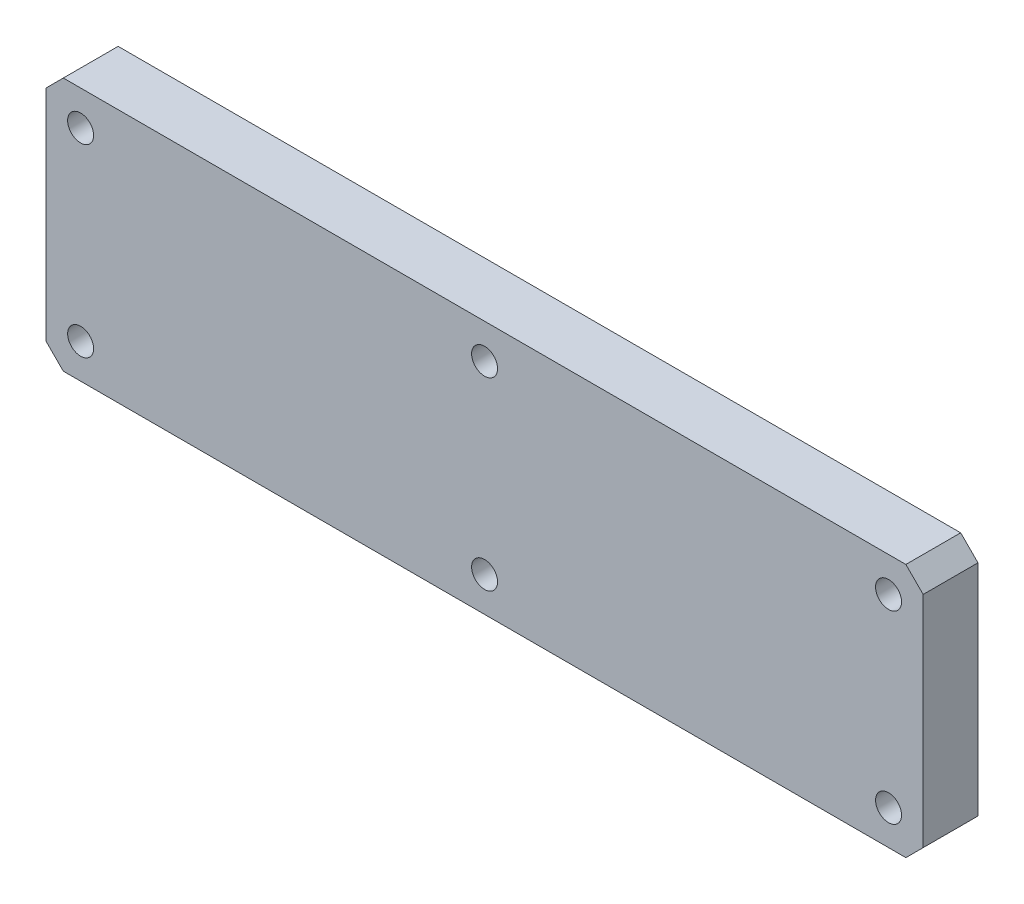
ISO-10303-21;
HEADER;
FILE_DESCRIPTION(('STEP AP214'),'2;1');
FILE_NAME('part.step','',(''),(''),'','','');
FILE_SCHEMA(('AUTOMOTIVE_DESIGN { 1 0 10303 214 1 1 1 1 }'));
ENDSEC;
DATA;
#1=APPLICATION_CONTEXT('core data for automotive mechanical design processes');
#2=APPLICATION_PROTOCOL_DEFINITION('international standard','automotive_design',2000,#1);
#3=PRODUCT_CONTEXT('',#1,'mechanical');
#4=PRODUCT('Part','Part','',(#3));
#5=PRODUCT_RELATED_PRODUCT_CATEGORY('part','',(#4));
#6=PRODUCT_DEFINITION_FORMATION('','',#4);
#7=PRODUCT_DEFINITION_CONTEXT('part definition',#1,'design');
#8=PRODUCT_DEFINITION('design','',#6,#7);
#9=PRODUCT_DEFINITION_SHAPE('','',#8);
#10=(LENGTH_UNIT() NAMED_UNIT(*) SI_UNIT(.MILLI.,.METRE.));
#11=(NAMED_UNIT(*) PLANE_ANGLE_UNIT() SI_UNIT($,.RADIAN.));
#12=(NAMED_UNIT(*) SI_UNIT($,.STERADIAN.) SOLID_ANGLE_UNIT());
#13=UNCERTAINTY_MEASURE_WITH_UNIT(LENGTH_MEASURE(1.E-05),#10,'distance_accuracy_value','');
#14=(GEOMETRIC_REPRESENTATION_CONTEXT(3) GLOBAL_UNCERTAINTY_ASSIGNED_CONTEXT((#13)) GLOBAL_UNIT_ASSIGNED_CONTEXT((#10,
#11,#12)) REPRESENTATION_CONTEXT('',''));
#15=CARTESIAN_POINT('',(0.,0.,0.));
#16=DIRECTION('',(0.,0.,1.));
#17=DIRECTION('',(1.,0.,0.));
#18=AXIS2_PLACEMENT_3D('',#15,#16,#17);
#19=CARTESIAN_POINT('',(6.00000000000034,5.99999999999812,2.05000000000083));
#20=DIRECTION('',(0.,0.,-1.));
#21=DIRECTION('',(-0.999999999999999,0.,0.));
#22=AXIS2_PLACEMENT_3D('',#19,#20,#21);
#23=CONICAL_SURFACE('',#22,2.25000000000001,0.785398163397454);
#24=CARTESIAN_POINT('',(5.99999999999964,5.99999999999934,2.77555756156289E-13));
#25=DIRECTION('',(0.,0.,-1.));
#26=DIRECTION('',(-0.999999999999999,0.,0.));
#27=AXIS2_PLACEMENT_3D('',#24,#25,#26);
#28=CIRCLE('',#27,4.30000000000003);
#29=CARTESIAN_POINT('',(1.69999999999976,5.99999999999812,2.78423117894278E-13));
#30=VERTEX_POINT('',#29);
#31=EDGE_CURVE('E171',#30,#30,#28,.F.);
#32=CARTESIAN_POINT('',(6.00000000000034,5.99999999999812,2.05000000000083));
#33=DIRECTION('',(0.,0.,-1.));
#34=DIRECTION('',(-0.999999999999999,0.,0.));
#35=AXIS2_PLACEMENT_3D('',#32,#33,#34);
#36=CIRCLE('',#35,2.25000000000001);
#37=CARTESIAN_POINT('',(3.75000000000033,5.99999999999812,2.05000000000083));
#38=VERTEX_POINT('',#37);
#39=EDGE_CURVE('E177',#38,#38,#36,.T.);
#40=CARTESIAN_POINT('',(1.69999999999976,5.99999999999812,2.78423117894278E-13));
#41=CARTESIAN_POINT('',(1.72135416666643,5.99999999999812,0.0213541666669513));
#42=CARTESIAN_POINT('',(1.7427083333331,5.99999999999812,0.0427083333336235));
#43=CARTESIAN_POINT('',(1.78541666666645,5.99999999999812,0.0854166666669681));
#44=CARTESIAN_POINT('',(1.80677083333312,5.99999999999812,0.10677083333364));
#45=CARTESIAN_POINT('',(1.84947916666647,5.99999999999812,0.149479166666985));
#46=CARTESIAN_POINT('',(1.87083333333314,5.99999999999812,0.170833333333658));
#47=CARTESIAN_POINT('',(1.91354166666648,5.99999999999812,0.213541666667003));
#48=CARTESIAN_POINT('',(1.93489583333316,5.99999999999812,0.234895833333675));
#49=CARTESIAN_POINT('',(1.9776041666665,5.99999999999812,0.27760416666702));
#50=CARTESIAN_POINT('',(1.99895833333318,5.99999999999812,0.298958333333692));
#51=CARTESIAN_POINT('',(2.04166666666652,5.99999999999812,0.341666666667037));
#52=CARTESIAN_POINT('',(2.06302083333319,5.99999999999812,0.363020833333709));
#53=CARTESIAN_POINT('',(2.10572916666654,5.99999999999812,0.405729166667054));
#54=CARTESIAN_POINT('',(2.12708333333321,5.99999999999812,0.427083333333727));
#55=CARTESIAN_POINT('',(2.16979166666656,5.99999999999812,0.469791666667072));
#56=CARTESIAN_POINT('',(2.19114583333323,5.99999999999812,0.491145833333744));
#57=CARTESIAN_POINT('',(2.23385416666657,5.99999999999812,0.533854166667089));
#58=CARTESIAN_POINT('',(2.25520833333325,5.99999999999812,0.555208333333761));
#59=CARTESIAN_POINT('',(2.29791666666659,5.99999999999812,0.597916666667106));
#60=CARTESIAN_POINT('',(2.31927083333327,5.99999999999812,0.619270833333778));
#61=CARTESIAN_POINT('',(2.36197916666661,5.99999999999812,0.661979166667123));
#62=CARTESIAN_POINT('',(2.38333333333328,5.99999999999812,0.683333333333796));
#63=CARTESIAN_POINT('',(2.42604166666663,5.99999999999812,0.726041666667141));
#64=CARTESIAN_POINT('',(2.4473958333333,5.99999999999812,0.747395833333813));
#65=CARTESIAN_POINT('',(2.49010416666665,5.99999999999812,0.790104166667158));
#66=CARTESIAN_POINT('',(2.51145833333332,5.99999999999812,0.81145833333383));
#67=CARTESIAN_POINT('',(2.55416666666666,5.99999999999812,0.854166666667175));
#68=CARTESIAN_POINT('',(2.57552083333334,5.99999999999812,0.875520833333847));
#69=CARTESIAN_POINT('',(2.61822916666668,5.99999999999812,0.918229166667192));
#70=CARTESIAN_POINT('',(2.63958333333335,5.99999999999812,0.939583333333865));
#71=CARTESIAN_POINT('',(2.6822916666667,5.99999999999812,0.982291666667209));
#72=CARTESIAN_POINT('',(2.70364583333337,5.99999999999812,1.00364583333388));
#73=CARTESIAN_POINT('',(2.74635416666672,5.99999999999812,1.04635416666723));
#74=CARTESIAN_POINT('',(2.76770833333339,5.99999999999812,1.0677083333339));
#75=CARTESIAN_POINT('',(2.81041666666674,5.99999999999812,1.11041666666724));
#76=CARTESIAN_POINT('',(2.83177083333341,5.99999999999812,1.13177083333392));
#77=CARTESIAN_POINT('',(2.87447916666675,5.99999999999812,1.17447916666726));
#78=CARTESIAN_POINT('',(2.89583333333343,5.99999999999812,1.19583333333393));
#79=CARTESIAN_POINT('',(2.93854166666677,5.99999999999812,1.23854166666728));
#80=CARTESIAN_POINT('',(2.95989583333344,5.99999999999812,1.25989583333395));
#81=CARTESIAN_POINT('',(3.00260416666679,5.99999999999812,1.3026041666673));
#82=CARTESIAN_POINT('',(3.02395833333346,5.99999999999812,1.32395833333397));
#83=CARTESIAN_POINT('',(3.06666666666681,5.99999999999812,1.36666666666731));
#84=CARTESIAN_POINT('',(3.08802083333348,5.99999999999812,1.38802083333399));
#85=CARTESIAN_POINT('',(3.13072916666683,5.99999999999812,1.43072916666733));
#86=CARTESIAN_POINT('',(3.1520833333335,5.99999999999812,1.452083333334));
#87=CARTESIAN_POINT('',(3.19479166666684,5.99999999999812,1.49479166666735));
#88=CARTESIAN_POINT('',(3.21614583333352,5.99999999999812,1.51614583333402));
#89=CARTESIAN_POINT('',(3.25885416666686,5.99999999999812,1.55885416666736));
#90=CARTESIAN_POINT('',(3.28020833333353,5.99999999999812,1.58020833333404));
#91=CARTESIAN_POINT('',(3.32291666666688,5.99999999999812,1.62291666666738));
#92=CARTESIAN_POINT('',(3.34427083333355,5.99999999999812,1.64427083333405));
#93=CARTESIAN_POINT('',(3.3869791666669,5.99999999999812,1.6869791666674));
#94=CARTESIAN_POINT('',(3.40833333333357,5.99999999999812,1.70833333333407));
#95=CARTESIAN_POINT('',(3.45104166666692,5.99999999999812,1.75104166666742));
#96=CARTESIAN_POINT('',(3.47239583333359,5.99999999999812,1.77239583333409));
#97=CARTESIAN_POINT('',(3.51510416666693,5.99999999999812,1.81510416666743));
#98=CARTESIAN_POINT('',(3.53645833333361,5.99999999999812,1.83645833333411));
#99=CARTESIAN_POINT('',(3.57916666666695,5.99999999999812,1.87916666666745));
#100=CARTESIAN_POINT('',(3.60052083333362,5.99999999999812,1.90052083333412));
#101=CARTESIAN_POINT('',(3.64322916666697,5.99999999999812,1.94322916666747));
#102=CARTESIAN_POINT('',(3.66458333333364,5.99999999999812,1.96458333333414));
#103=CARTESIAN_POINT('',(3.70729166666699,5.99999999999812,2.00729166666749));
#104=CARTESIAN_POINT('',(3.72864583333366,5.99999999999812,2.02864583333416));
#105=CARTESIAN_POINT('',(3.75000000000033,5.99999999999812,2.05000000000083));
#106=B_SPLINE_CURVE_WITH_KNOTS('',3,(#40,#41,#42,#43,#44,#45,#46,#47,#48,#49,#50,#51,#52,#53,
#54,#55,#56,#57,#58,#59,#60,#61,#62,#63,#64,#65,#66,#67,#68,#69,#70,#71,#72,#73,#74,#75,#76,#77,
#78,#79,#80,#81,#82,#83,#84,#85,#86,#87,#88,#89,#90,#91,#92,#93,#94,#95,#96,#97,#98,#99,#100,
#101,#102,#103,#104,#105),.UNSPECIFIED.,.F.,.F.,(4,2,2,2,2,2,2,2,2,2,2,2,2,2,2,2,2,2,2,2,2,2,2,
2,2,2,2,2,2,2,2,2,4),(0.,0.0905980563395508,0.181196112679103,0.271794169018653,
0.362392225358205,0.452990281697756,0.543588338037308,0.634186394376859,0.72478445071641,
0.815382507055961,0.905980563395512,0.996578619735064,1.08717667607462,1.17777473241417,
1.26837278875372,1.35897084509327,1.44956890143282,1.54016695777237,1.63076501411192,
1.72136307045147,1.81196112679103,1.90255918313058,1.99315723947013,2.08375529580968,
2.17435335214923,2.26495140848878,2.35554946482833,2.44614752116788,2.53674557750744,
2.62734363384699,2.71794169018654,2.80853974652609,2.89913780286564),.UNSPECIFIED.);
#107=EDGE_CURVE('BSEAM36',#30,#38,#106,.T.);
#108=ORIENTED_EDGE('',*,*,#31,.F.);
#109=ORIENTED_EDGE('',*,*,#39,.F.);
#110=ORIENTED_EDGE('',*,*,#107,.T.);
#111=ORIENTED_EDGE('',*,*,#107,.F.);
#112=EDGE_LOOP('',(#108,#110,#109,#111));
#113=FACE_BOUND('',#112,.T.);
#114=ADVANCED_FACE('F36',(#113),#23,.F.);
#115=CARTESIAN_POINT('',(5.99999999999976,5.99999999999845,9.50000000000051));
#116=DIRECTION('',(0.,0.,-1.));
#117=DIRECTION('',(-0.999999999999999,0.,0.));
#118=AXIS2_PLACEMENT_3D('',#115,#116,#117);
#119=CYLINDRICAL_SURFACE('',#118,2.25000000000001);
#120=CARTESIAN_POINT('',(5.99999999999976,5.99999999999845,9.50000000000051));
#121=DIRECTION('',(0.,0.,-1.));
#122=DIRECTION('',(-0.999999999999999,0.,0.));
#123=AXIS2_PLACEMENT_3D('',#120,#121,#122);
#124=CIRCLE('',#123,2.25000000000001);
#125=CARTESIAN_POINT('',(3.74999999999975,5.99999999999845,9.50000000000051));
#126=VERTEX_POINT('',#125);
#127=EDGE_CURVE('E174',#126,#126,#124,.T.);
#128=CARTESIAN_POINT('',(3.74999999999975,5.99999999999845,2.05000000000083));
#129=CARTESIAN_POINT('',(3.74999999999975,5.99999999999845,2.12760416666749));
#130=CARTESIAN_POINT('',(3.74999999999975,5.99999999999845,2.20520833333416));
#131=CARTESIAN_POINT('',(3.74999999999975,5.99999999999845,2.36041666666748));
#132=CARTESIAN_POINT('',(3.74999999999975,5.99999999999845,2.43802083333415));
#133=CARTESIAN_POINT('',(3.74999999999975,5.99999999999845,2.59322916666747));
#134=CARTESIAN_POINT('',(3.74999999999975,5.99999999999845,2.67083333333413));
#135=CARTESIAN_POINT('',(3.74999999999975,5.99999999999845,2.82604166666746));
#136=CARTESIAN_POINT('',(3.74999999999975,5.99999999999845,2.90364583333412));
#137=CARTESIAN_POINT('',(3.74999999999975,5.99999999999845,3.05885416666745));
#138=CARTESIAN_POINT('',(3.74999999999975,5.99999999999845,3.13645833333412));
#139=CARTESIAN_POINT('',(3.74999999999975,5.99999999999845,3.29166666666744));
#140=CARTESIAN_POINT('',(3.74999999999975,5.99999999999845,3.36927083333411));
#141=CARTESIAN_POINT('',(3.74999999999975,5.99999999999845,3.52447916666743));
#142=CARTESIAN_POINT('',(3.74999999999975,5.99999999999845,3.6020833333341));
#143=CARTESIAN_POINT('',(3.74999999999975,5.99999999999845,3.75729166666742));
#144=CARTESIAN_POINT('',(3.74999999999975,5.99999999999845,3.83489583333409));
#145=CARTESIAN_POINT('',(3.74999999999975,5.99999999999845,3.99010416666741));
#146=CARTESIAN_POINT('',(3.74999999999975,5.99999999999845,4.06770833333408));
#147=CARTESIAN_POINT('',(3.74999999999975,5.99999999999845,4.2229166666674));
#148=CARTESIAN_POINT('',(3.74999999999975,5.99999999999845,4.30052083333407));
#149=CARTESIAN_POINT('',(3.74999999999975,5.99999999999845,4.45572916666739));
#150=CARTESIAN_POINT('',(3.74999999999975,5.99999999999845,4.53333333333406));
#151=CARTESIAN_POINT('',(3.74999999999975,5.99999999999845,4.68854166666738));
#152=CARTESIAN_POINT('',(3.74999999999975,5.99999999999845,4.76614583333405));
#153=CARTESIAN_POINT('',(3.74999999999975,5.99999999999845,4.92135416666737));
#154=CARTESIAN_POINT('',(3.74999999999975,5.99999999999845,4.99895833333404));
#155=CARTESIAN_POINT('',(3.74999999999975,5.99999999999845,5.15416666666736));
#156=CARTESIAN_POINT('',(3.74999999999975,5.99999999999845,5.23177083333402));
#157=CARTESIAN_POINT('',(3.74999999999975,5.99999999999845,5.38697916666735));
#158=CARTESIAN_POINT('',(3.74999999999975,5.99999999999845,5.46458333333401));
#159=CARTESIAN_POINT('',(3.74999999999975,5.99999999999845,5.61979166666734));
#160=CARTESIAN_POINT('',(3.74999999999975,5.99999999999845,5.69739583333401));
#161=CARTESIAN_POINT('',(3.74999999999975,5.99999999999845,5.85260416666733));
#162=CARTESIAN_POINT('',(3.74999999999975,5.99999999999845,5.930208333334));
#163=CARTESIAN_POINT('',(3.74999999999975,5.99999999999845,6.08541666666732));
#164=CARTESIAN_POINT('',(3.74999999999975,5.99999999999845,6.16302083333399));
#165=CARTESIAN_POINT('',(3.74999999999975,5.99999999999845,6.31822916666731));
#166=CARTESIAN_POINT('',(3.74999999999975,5.99999999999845,6.39583333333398));
#167=CARTESIAN_POINT('',(3.74999999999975,5.99999999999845,6.5510416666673));
#168=CARTESIAN_POINT('',(3.74999999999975,5.99999999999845,6.62864583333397));
#169=CARTESIAN_POINT('',(3.74999999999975,5.99999999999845,6.78385416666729));
#170=CARTESIAN_POINT('',(3.74999999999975,5.99999999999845,6.86145833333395));
#171=CARTESIAN_POINT('',(3.74999999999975,5.99999999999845,7.01666666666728));
#172=CARTESIAN_POINT('',(3.74999999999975,5.99999999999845,7.09427083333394));
#173=CARTESIAN_POINT('',(3.74999999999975,5.99999999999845,7.24947916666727));
#174=CARTESIAN_POINT('',(3.74999999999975,5.99999999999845,7.32708333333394));
#175=CARTESIAN_POINT('',(3.74999999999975,5.99999999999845,7.48229166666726));
#176=CARTESIAN_POINT('',(3.74999999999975,5.99999999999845,7.55989583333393));
#177=CARTESIAN_POINT('',(3.74999999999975,5.99999999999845,7.71510416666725));
#178=CARTESIAN_POINT('',(3.74999999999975,5.99999999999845,7.79270833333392));
#179=CARTESIAN_POINT('',(3.74999999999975,5.99999999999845,7.94791666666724));
#180=CARTESIAN_POINT('',(3.74999999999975,5.99999999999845,8.02552083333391));
#181=CARTESIAN_POINT('',(3.74999999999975,5.99999999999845,8.18072916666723));
#182=CARTESIAN_POINT('',(3.74999999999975,5.99999999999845,8.25833333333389));
#183=CARTESIAN_POINT('',(3.74999999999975,5.99999999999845,8.41354166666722));
#184=CARTESIAN_POINT('',(3.74999999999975,5.99999999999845,8.49114583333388));
#185=CARTESIAN_POINT('',(3.74999999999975,5.99999999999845,8.64635416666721));
#186=CARTESIAN_POINT('',(3.74999999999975,5.99999999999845,8.72395833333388));
#187=CARTESIAN_POINT('',(3.74999999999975,5.99999999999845,8.8791666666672));
#188=CARTESIAN_POINT('',(3.74999999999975,5.99999999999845,8.95677083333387));
#189=CARTESIAN_POINT('',(3.74999999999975,5.99999999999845,9.11197916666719));
#190=CARTESIAN_POINT('',(3.74999999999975,5.99999999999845,9.18958333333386));
#191=CARTESIAN_POINT('',(3.74999999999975,5.99999999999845,9.34479166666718));
#192=CARTESIAN_POINT('',(3.74999999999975,5.99999999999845,9.42239583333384));
#193=CARTESIAN_POINT('',(3.74999999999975,5.99999999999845,9.50000000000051));
#194=B_SPLINE_CURVE_WITH_KNOTS('',3,(#128,#129,#130,#131,#132,#133,#134,#135,#136,#137,#138,
#139,#140,#141,#142,#143,#144,#145,#146,#147,#148,#149,#150,#151,#152,#153,#154,#155,#156,#157,
#158,#159,#160,#161,#162,#163,#164,#165,#166,#167,#168,#169,#170,#171,#172,#173,#174,#175,#176,
#177,#178,#179,#180,#181,#182,#183,#184,#185,#186,#187,#188,#189,#190,#191,#192,#193),
.UNSPECIFIED.,.F.,.F.,(4,2,2,2,2,2,2,2,2,2,2,2,2,2,2,2,2,2,2,2,2,2,2,2,2,2,2,2,2,2,2,2,4),(0.,
0.23281249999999,0.46562499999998,0.698437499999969,0.93124999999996,1.16406249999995,
1.39687499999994,1.62968749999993,1.86249999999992,2.09531249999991,2.3281249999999,
2.56093749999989,2.79374999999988,3.02656249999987,3.25937499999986,3.49218749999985,
3.72499999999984,3.95781249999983,4.19062499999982,4.42343749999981,4.6562499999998,
4.88906249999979,5.12187499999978,5.35468749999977,5.58749999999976,5.82031249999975,
6.05312499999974,6.28593749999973,6.51874999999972,6.75156249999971,6.9843749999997,
7.21718749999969,7.44999999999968),.UNSPECIFIED.);
#195=EDGE_CURVE('BSEAM259',#38,#126,#194,.T.);
#196=ORIENTED_EDGE('',*,*,#39,.T.);
#197=ORIENTED_EDGE('',*,*,#127,.F.);
#198=ORIENTED_EDGE('',*,*,#195,.T.);
#199=ORIENTED_EDGE('',*,*,#195,.F.);
#200=EDGE_LOOP('',(#196,#198,#197,#199));
#201=FACE_BOUND('',#200,.T.);
#202=ADVANCED_FACE('F259',(#201),#119,.F.);
#203=CARTESIAN_POINT('',(75.9999999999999,5.99999999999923,2.04999999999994));
#204=DIRECTION('',(0.,0.,-1.));
#205=DIRECTION('',(-0.999999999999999,0.,0.));
#206=AXIS2_PLACEMENT_3D('',#203,#204,#205);
#207=CONICAL_SURFACE('',#206,2.25000000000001,0.785398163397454);
#208=CARTESIAN_POINT('',(75.9999999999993,5.99999999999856,4.44089209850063E-13));
#209=DIRECTION('',(0.,0.,-1.));
#210=DIRECTION('',(-0.999999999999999,0.,0.));
#211=AXIS2_PLACEMENT_3D('',#208,#209,#210);
#212=CIRCLE('',#211,4.30000000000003);
#213=CARTESIAN_POINT('',(71.7000000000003,5.99999999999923,4.44956571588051E-13));
#214=VERTEX_POINT('',#213);
#215=EDGE_CURVE('E162',#214,#214,#212,.F.);
#216=CARTESIAN_POINT('',(75.9999999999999,5.99999999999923,2.04999999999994));
#217=DIRECTION('',(0.,0.,-1.));
#218=DIRECTION('',(-0.999999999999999,0.,0.));
#219=AXIS2_PLACEMENT_3D('',#216,#217,#218);
#220=CIRCLE('',#219,2.25000000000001);
#221=CARTESIAN_POINT('',(73.7499999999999,5.99999999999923,2.04999999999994));
#222=VERTEX_POINT('',#221);
#223=EDGE_CURVE('E168',#222,#222,#220,.T.);
#224=CARTESIAN_POINT('',(71.7000000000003,5.99999999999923,4.44956571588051E-13));
#225=CARTESIAN_POINT('',(71.721354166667,5.99999999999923,0.0213541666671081));
#226=CARTESIAN_POINT('',(71.7427083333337,5.99999999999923,0.0427083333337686));
#227=CARTESIAN_POINT('',(71.785416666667,5.99999999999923,0.0854166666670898));
#228=CARTESIAN_POINT('',(71.8067708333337,5.99999999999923,0.10677083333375));
#229=CARTESIAN_POINT('',(71.849479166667,5.99999999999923,0.149479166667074));
#230=CARTESIAN_POINT('',(71.8708333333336,5.99999999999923,0.170833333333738));
#231=CARTESIAN_POINT('',(71.913541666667,5.99999999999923,0.21354166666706));
#232=CARTESIAN_POINT('',(71.9348958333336,5.99999999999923,0.23489583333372));
#233=CARTESIAN_POINT('',(71.9776041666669,5.99999999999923,0.277604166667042));
#234=CARTESIAN_POINT('',(71.9989583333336,5.99999999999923,0.298958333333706));
#235=CARTESIAN_POINT('',(72.0416666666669,5.99999999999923,0.341666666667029));
#236=CARTESIAN_POINT('',(72.0630208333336,5.99999999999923,0.363020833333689));
#237=CARTESIAN_POINT('',(72.1057291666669,5.99999999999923,0.405729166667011));
#238=CARTESIAN_POINT('',(72.1270833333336,5.99999999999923,0.427083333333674));
#239=CARTESIAN_POINT('',(72.1697916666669,5.99999999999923,0.469791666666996));
#240=CARTESIAN_POINT('',(72.1911458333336,5.99999999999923,0.491145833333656));
#241=CARTESIAN_POINT('',(72.2338541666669,5.99999999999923,0.533854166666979));
#242=CARTESIAN_POINT('',(72.2552083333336,5.99999999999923,0.555208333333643));
#243=CARTESIAN_POINT('',(72.2979166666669,5.99999999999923,0.597916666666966));
#244=CARTESIAN_POINT('',(72.3192708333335,5.99999999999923,0.619270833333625));
#245=CARTESIAN_POINT('',(72.3619791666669,5.99999999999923,0.661979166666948));
#246=CARTESIAN_POINT('',(72.3833333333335,5.99999999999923,0.683333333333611));
#247=CARTESIAN_POINT('',(72.4260416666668,5.99999999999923,0.726041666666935));
#248=CARTESIAN_POINT('',(72.4473958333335,5.99999999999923,0.747395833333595));
#249=CARTESIAN_POINT('',(72.4901041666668,5.99999999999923,0.790104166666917));
#250=CARTESIAN_POINT('',(72.5114583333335,5.99999999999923,0.811458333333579));
#251=CARTESIAN_POINT('',(72.5541666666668,5.99999999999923,0.854166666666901));
#252=CARTESIAN_POINT('',(72.5755208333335,5.99999999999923,0.875520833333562));
#253=CARTESIAN_POINT('',(72.6182291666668,5.99999999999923,0.918229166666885));
#254=CARTESIAN_POINT('',(72.6395833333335,5.99999999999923,0.939583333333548));
#255=CARTESIAN_POINT('',(72.6822916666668,5.99999999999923,0.982291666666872));
#256=CARTESIAN_POINT('',(72.7036458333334,5.99999999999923,1.00364583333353));
#257=CARTESIAN_POINT('',(72.7463541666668,5.99999999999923,1.04635416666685));
#258=CARTESIAN_POINT('',(72.7677083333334,5.99999999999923,1.06770833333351));
#259=CARTESIAN_POINT('',(72.8104166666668,5.99999999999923,1.11041666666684));
#260=CARTESIAN_POINT('',(72.8317708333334,5.99999999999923,1.1317708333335));
#261=CARTESIAN_POINT('',(72.8744791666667,5.99999999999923,1.17447916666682));
#262=CARTESIAN_POINT('',(72.8958333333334,5.99999999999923,1.19583333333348));
#263=CARTESIAN_POINT('',(72.9385416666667,5.99999999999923,1.23854166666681));
#264=CARTESIAN_POINT('',(72.9598958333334,5.99999999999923,1.25989583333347));
#265=CARTESIAN_POINT('',(73.0026041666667,5.99999999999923,1.30260416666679));
#266=CARTESIAN_POINT('',(73.0239583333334,5.99999999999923,1.32395833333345));
#267=CARTESIAN_POINT('',(73.0666666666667,5.99999999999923,1.36666666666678));
#268=CARTESIAN_POINT('',(73.0880208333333,5.99999999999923,1.38802083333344));
#269=CARTESIAN_POINT('',(73.1307291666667,5.99999999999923,1.43072916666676));
#270=CARTESIAN_POINT('',(73.1520833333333,5.99999999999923,1.45208333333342));
#271=CARTESIAN_POINT('',(73.1947916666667,5.99999999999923,1.49479166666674));
#272=CARTESIAN_POINT('',(73.2161458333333,5.99999999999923,1.51614583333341));
#273=CARTESIAN_POINT('',(73.2588541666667,5.99999999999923,1.55885416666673));
#274=CARTESIAN_POINT('',(73.2802083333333,5.99999999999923,1.58020833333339));
#275=CARTESIAN_POINT('',(73.3229166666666,5.99999999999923,1.62291666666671));
#276=CARTESIAN_POINT('',(73.3442708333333,5.99999999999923,1.64427083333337));
#277=CARTESIAN_POINT('',(73.3869791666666,5.99999999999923,1.6869791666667));
#278=CARTESIAN_POINT('',(73.4083333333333,5.99999999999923,1.70833333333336));
#279=CARTESIAN_POINT('',(73.4510416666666,5.99999999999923,1.75104166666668));
#280=CARTESIAN_POINT('',(73.4723958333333,5.99999999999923,1.77239583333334));
#281=CARTESIAN_POINT('',(73.5151041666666,5.99999999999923,1.81510416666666));
#282=CARTESIAN_POINT('',(73.5364583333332,5.99999999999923,1.83645833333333));
#283=CARTESIAN_POINT('',(73.5791666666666,5.99999999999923,1.87916666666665));
#284=CARTESIAN_POINT('',(73.6005208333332,5.99999999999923,1.90052083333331));
#285=CARTESIAN_POINT('',(73.6432291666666,5.99999999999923,1.94322916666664));
#286=CARTESIAN_POINT('',(73.6645833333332,5.99999999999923,1.9645833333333));
#287=CARTESIAN_POINT('',(73.7072916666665,5.99999999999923,2.00729166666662));
#288=CARTESIAN_POINT('',(73.7286458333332,5.99999999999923,2.02864583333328));
#289=CARTESIAN_POINT('',(73.7499999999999,5.99999999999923,2.04999999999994));
#290=B_SPLINE_CURVE_WITH_KNOTS('',3,(#224,#225,#226,#227,#228,#229,#230,#231,#232,#233,#234,
#235,#236,#237,#238,#239,#240,#241,#242,#243,#244,#245,#246,#247,#248,#249,#250,#251,#252,#253,
#254,#255,#256,#257,#258,#259,#260,#261,#262,#263,#264,#265,#266,#267,#268,#269,#270,#271,#272,
#273,#274,#275,#276,#277,#278,#279,#280,#281,#282,#283,#284,#285,#286,#287,#288,#289),
.UNSPECIFIED.,.F.,.F.,(4,2,2,2,2,2,2,2,2,2,2,2,2,2,2,2,2,2,2,2,2,2,2,2,2,2,2,2,2,2,2,2,4),(0.,
0.0905980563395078,0.181196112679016,0.271794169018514,0.362392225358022,0.45299028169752,
0.543588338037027,0.634186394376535,0.724784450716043,0.815382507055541,0.905980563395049,
0.996578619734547,1.08717667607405,1.17777473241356,1.26837278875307,1.35897084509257,
1.44956890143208,1.54016695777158,1.63076501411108,1.72136307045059,1.8119611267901,
1.9025591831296,1.9931572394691,2.08375529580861,2.17435335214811,2.26495140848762,
2.35554946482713,2.44614752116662,2.53674557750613,2.62734363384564,2.71794169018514,
2.80853974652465,2.89913780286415),.UNSPECIFIED.);
#291=EDGE_CURVE('BSEAM261',#214,#222,#290,.T.);
#292=ORIENTED_EDGE('',*,*,#215,.F.);
#293=ORIENTED_EDGE('',*,*,#223,.F.);
#294=ORIENTED_EDGE('',*,*,#291,.T.);
#295=ORIENTED_EDGE('',*,*,#291,.F.);
#296=EDGE_LOOP('',(#292,#294,#293,#295));
#297=FACE_BOUND('',#296,.T.);
#298=ADVANCED_FACE('F261',(#297),#207,.F.);
#299=CARTESIAN_POINT('',(75.9999999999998,5.99999999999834,9.50000000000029));
#300=DIRECTION('',(0.,0.,-1.));
#301=DIRECTION('',(-0.999999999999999,0.,0.));
#302=AXIS2_PLACEMENT_3D('',#299,#300,#301);
#303=CYLINDRICAL_SURFACE('',#302,2.25000000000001);
#304=CARTESIAN_POINT('',(75.9999999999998,5.99999999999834,9.50000000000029));
#305=DIRECTION('',(0.,0.,-1.));
#306=DIRECTION('',(-0.999999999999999,0.,0.));
#307=AXIS2_PLACEMENT_3D('',#304,#305,#306);
#308=CIRCLE('',#307,2.25000000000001);
#309=CARTESIAN_POINT('',(73.7499999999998,5.99999999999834,9.50000000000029));
#310=VERTEX_POINT('',#309);
#311=EDGE_CURVE('E165',#310,#310,#308,.T.);
#312=CARTESIAN_POINT('',(73.7499999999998,5.99999999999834,2.04999999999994));
#313=CARTESIAN_POINT('',(73.7499999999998,5.99999999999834,2.12760416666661));
#314=CARTESIAN_POINT('',(73.7499999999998,5.99999999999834,2.20520833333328));
#315=CARTESIAN_POINT('',(73.7499999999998,5.99999999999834,2.36041666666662));
#316=CARTESIAN_POINT('',(73.7499999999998,5.99999999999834,2.43802083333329));
#317=CARTESIAN_POINT('',(73.7499999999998,5.99999999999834,2.59322916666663));
#318=CARTESIAN_POINT('',(73.7499999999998,5.99999999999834,2.6708333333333));
#319=CARTESIAN_POINT('',(73.7499999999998,5.99999999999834,2.82604166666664));
#320=CARTESIAN_POINT('',(73.7499999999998,5.99999999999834,2.90364583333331));
#321=CARTESIAN_POINT('',(73.7499999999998,5.99999999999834,3.05885416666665));
#322=CARTESIAN_POINT('',(73.7499999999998,5.99999999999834,3.13645833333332));
#323=CARTESIAN_POINT('',(73.7499999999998,5.99999999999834,3.29166666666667));
#324=CARTESIAN_POINT('',(73.7499999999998,5.99999999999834,3.36927083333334));
#325=CARTESIAN_POINT('',(73.7499999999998,5.99999999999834,3.52447916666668));
#326=CARTESIAN_POINT('',(73.7499999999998,5.99999999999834,3.60208333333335));
#327=CARTESIAN_POINT('',(73.7499999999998,5.99999999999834,3.75729166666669));
#328=CARTESIAN_POINT('',(73.7499999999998,5.99999999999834,3.83489583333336));
#329=CARTESIAN_POINT('',(73.7499999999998,5.99999999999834,3.9901041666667));
#330=CARTESIAN_POINT('',(73.7499999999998,5.99999999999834,4.06770833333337));
#331=CARTESIAN_POINT('',(73.7499999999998,5.99999999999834,4.22291666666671));
#332=CARTESIAN_POINT('',(73.7499999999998,5.99999999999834,4.30052083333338));
#333=CARTESIAN_POINT('',(73.7499999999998,5.99999999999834,4.45572916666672));
#334=CARTESIAN_POINT('',(73.7499999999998,5.99999999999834,4.53333333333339));
#335=CARTESIAN_POINT('',(73.7499999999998,5.99999999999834,4.68854166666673));
#336=CARTESIAN_POINT('',(73.7499999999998,5.99999999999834,4.7661458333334));
#337=CARTESIAN_POINT('',(73.7499999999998,5.99999999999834,4.92135416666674));
#338=CARTESIAN_POINT('',(73.7499999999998,5.99999999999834,4.99895833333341));
#339=CARTESIAN_POINT('',(73.7499999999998,5.99999999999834,5.15416666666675));
#340=CARTESIAN_POINT('',(73.7499999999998,5.99999999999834,5.23177083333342));
#341=CARTESIAN_POINT('',(73.7499999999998,5.99999999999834,5.38697916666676));
#342=CARTESIAN_POINT('',(73.7499999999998,5.99999999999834,5.46458333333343));
#343=CARTESIAN_POINT('',(73.7499999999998,5.99999999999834,5.61979166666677));
#344=CARTESIAN_POINT('',(73.7499999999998,5.99999999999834,5.69739583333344));
#345=CARTESIAN_POINT('',(73.7499999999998,5.99999999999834,5.85260416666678));
#346=CARTESIAN_POINT('',(73.7499999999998,5.99999999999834,5.93020833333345));
#347=CARTESIAN_POINT('',(73.7499999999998,5.99999999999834,6.0854166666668));
#348=CARTESIAN_POINT('',(73.7499999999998,5.99999999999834,6.16302083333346));
#349=CARTESIAN_POINT('',(73.7499999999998,5.99999999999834,6.31822916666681));
#350=CARTESIAN_POINT('',(73.7499999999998,5.99999999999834,6.39583333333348));
#351=CARTESIAN_POINT('',(73.7499999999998,5.99999999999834,6.55104166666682));
#352=CARTESIAN_POINT('',(73.7499999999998,5.99999999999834,6.62864583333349));
#353=CARTESIAN_POINT('',(73.7499999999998,5.99999999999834,6.78385416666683));
#354=CARTESIAN_POINT('',(73.7499999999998,5.99999999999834,6.8614583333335));
#355=CARTESIAN_POINT('',(73.7499999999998,5.99999999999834,7.01666666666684));
#356=CARTESIAN_POINT('',(73.7499999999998,5.99999999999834,7.09427083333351));
#357=CARTESIAN_POINT('',(73.7499999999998,5.99999999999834,7.24947916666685));
#358=CARTESIAN_POINT('',(73.7499999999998,5.99999999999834,7.32708333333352));
#359=CARTESIAN_POINT('',(73.7499999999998,5.99999999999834,7.48229166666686));
#360=CARTESIAN_POINT('',(73.7499999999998,5.99999999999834,7.55989583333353));
#361=CARTESIAN_POINT('',(73.7499999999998,5.99999999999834,7.71510416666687));
#362=CARTESIAN_POINT('',(73.7499999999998,5.99999999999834,7.79270833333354));
#363=CARTESIAN_POINT('',(73.7499999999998,5.99999999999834,7.94791666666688));
#364=CARTESIAN_POINT('',(73.7499999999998,5.99999999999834,8.02552083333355));
#365=CARTESIAN_POINT('',(73.7499999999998,5.99999999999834,8.18072916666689));
#366=CARTESIAN_POINT('',(73.7499999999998,5.99999999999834,8.25833333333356));
#367=CARTESIAN_POINT('',(73.7499999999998,5.99999999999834,8.4135416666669));
#368=CARTESIAN_POINT('',(73.7499999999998,5.99999999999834,8.49114583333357));
#369=CARTESIAN_POINT('',(73.7499999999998,5.99999999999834,8.64635416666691));
#370=CARTESIAN_POINT('',(73.7499999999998,5.99999999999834,8.72395833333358));
#371=CARTESIAN_POINT('',(73.7499999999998,5.99999999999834,8.87916666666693));
#372=CARTESIAN_POINT('',(73.7499999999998,5.99999999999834,8.9567708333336));
#373=CARTESIAN_POINT('',(73.7499999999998,5.99999999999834,9.11197916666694));
#374=CARTESIAN_POINT('',(73.7499999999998,5.99999999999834,9.18958333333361));
#375=CARTESIAN_POINT('',(73.7499999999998,5.99999999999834,9.34479166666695));
#376=CARTESIAN_POINT('',(73.7499999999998,5.99999999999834,9.42239583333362));
#377=CARTESIAN_POINT('',(73.7499999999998,5.99999999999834,9.50000000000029));
#378=B_SPLINE_CURVE_WITH_KNOTS('',3,(#312,#313,#314,#315,#316,#317,#318,#319,#320,#321,#322,
#323,#324,#325,#326,#327,#328,#329,#330,#331,#332,#333,#334,#335,#336,#337,#338,#339,#340,#341,
#342,#343,#344,#345,#346,#347,#348,#349,#350,#351,#352,#353,#354,#355,#356,#357,#358,#359,#360,
#361,#362,#363,#364,#365,#366,#367,#368,#369,#370,#371,#372,#373,#374,#375,#376,#377),
.UNSPECIFIED.,.F.,.F.,(4,2,2,2,2,2,2,2,2,2,2,2,2,2,2,2,2,2,2,2,2,2,2,2,2,2,2,2,2,2,2,2,4),(0.,
0.232812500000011,0.465625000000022,0.698437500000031,0.931250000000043,1.16406250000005,
1.39687500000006,1.62968750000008,1.86250000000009,2.0953125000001,2.32812500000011,
2.56093750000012,2.79375000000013,3.02656250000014,3.25937500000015,3.49218750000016,
3.72500000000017,3.95781250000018,4.19062500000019,4.4234375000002,4.65625000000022,
4.88906250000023,5.12187500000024,5.35468750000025,5.58750000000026,5.82031250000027,
6.05312500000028,6.28593750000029,6.5187500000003,6.75156250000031,6.98437500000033,
7.21718750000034,7.45000000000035),.UNSPECIFIED.);
#379=EDGE_CURVE('BSEAM268',#222,#310,#378,.T.);
#380=ORIENTED_EDGE('',*,*,#223,.T.);
#381=ORIENTED_EDGE('',*,*,#311,.F.);
#382=ORIENTED_EDGE('',*,*,#379,.T.);
#383=ORIENTED_EDGE('',*,*,#379,.F.);
#384=EDGE_LOOP('',(#380,#382,#381,#383));
#385=FACE_BOUND('',#384,.T.);
#386=ADVANCED_FACE('F268',(#385),#303,.F.);
#387=CARTESIAN_POINT('',(146.,5.9999999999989,2.05000000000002));
#388=DIRECTION('',(0.,0.,-1.));
#389=DIRECTION('',(-0.999999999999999,0.,0.));
#390=AXIS2_PLACEMENT_3D('',#387,#388,#389);
#391=CONICAL_SURFACE('',#390,2.25000000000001,0.785398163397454);
#392=CARTESIAN_POINT('',(145.999999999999,5.99999999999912,3.05311331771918E-13));
#393=DIRECTION('',(0.,0.,-1.));
#394=DIRECTION('',(-0.999999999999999,0.,0.));
#395=AXIS2_PLACEMENT_3D('',#392,#393,#394);
#396=CIRCLE('',#395,4.30000000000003);
#397=CARTESIAN_POINT('',(141.7,5.9999999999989,3.06178693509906E-13));
#398=VERTEX_POINT('',#397);
#399=EDGE_CURVE('E153',#398,#398,#396,.F.);
#400=CARTESIAN_POINT('',(146.,5.9999999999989,2.05000000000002));
#401=DIRECTION('',(0.,0.,-1.));
#402=DIRECTION('',(-0.999999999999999,0.,0.));
#403=AXIS2_PLACEMENT_3D('',#400,#401,#402);
#404=CIRCLE('',#403,2.25000000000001);
#405=CARTESIAN_POINT('',(143.75,5.9999999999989,2.05000000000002));
#406=VERTEX_POINT('',#405);
#407=EDGE_CURVE('E159',#406,#406,#404,.T.);
#408=CARTESIAN_POINT('',(141.7,5.9999999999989,3.06178693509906E-13));
#409=CARTESIAN_POINT('',(141.721354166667,5.9999999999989,0.02135416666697));
#410=CARTESIAN_POINT('',(141.742708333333,5.9999999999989,0.0427083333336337));
#411=CARTESIAN_POINT('',(141.785416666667,5.9999999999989,0.0854166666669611));
#412=CARTESIAN_POINT('',(141.806770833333,5.9999999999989,0.106770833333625));
#413=CARTESIAN_POINT('',(141.849479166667,5.9999999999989,0.149479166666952));
#414=CARTESIAN_POINT('',(141.870833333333,5.9999999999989,0.170833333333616));
#415=CARTESIAN_POINT('',(141.913541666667,5.9999999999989,0.213541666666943));
#416=CARTESIAN_POINT('',(141.934895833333,5.9999999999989,0.234895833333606));
#417=CARTESIAN_POINT('',(141.977604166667,5.9999999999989,0.277604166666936));
#418=CARTESIAN_POINT('',(141.998958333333,5.9999999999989,0.298958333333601));
#419=CARTESIAN_POINT('',(142.041666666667,5.9999999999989,0.341666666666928));
#420=CARTESIAN_POINT('',(142.063020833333,5.9999999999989,0.363020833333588));
#421=CARTESIAN_POINT('',(142.105729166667,5.9999999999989,0.405729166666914));
#422=CARTESIAN_POINT('',(142.127083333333,5.9999999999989,0.42708333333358));
#423=CARTESIAN_POINT('',(142.169791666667,5.9999999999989,0.469791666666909));
#424=CARTESIAN_POINT('',(142.191145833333,5.9999999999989,0.491145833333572));
#425=CARTESIAN_POINT('',(142.233854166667,5.9999999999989,0.533854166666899));
#426=CARTESIAN_POINT('',(142.255208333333,5.9999999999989,0.555208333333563));
#427=CARTESIAN_POINT('',(142.297916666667,5.9999999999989,0.597916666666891));
#428=CARTESIAN_POINT('',(142.319270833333,5.9999999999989,0.619270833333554));
#429=CARTESIAN_POINT('',(142.361979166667,5.9999999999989,0.661979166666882));
#430=CARTESIAN_POINT('',(142.383333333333,5.9999999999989,0.683333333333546));
#431=CARTESIAN_POINT('',(142.426041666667,5.9999999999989,0.726041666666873));
#432=CARTESIAN_POINT('',(142.447395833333,5.9999999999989,0.747395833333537));
#433=CARTESIAN_POINT('',(142.490104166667,5.9999999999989,0.790104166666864));
#434=CARTESIAN_POINT('',(142.511458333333,5.9999999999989,0.811458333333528));
#435=CARTESIAN_POINT('',(142.554166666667,5.9999999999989,0.854166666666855));
#436=CARTESIAN_POINT('',(142.575520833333,5.9999999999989,0.875520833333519));
#437=CARTESIAN_POINT('',(142.618229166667,5.9999999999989,0.918229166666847));
#438=CARTESIAN_POINT('',(142.639583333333,5.9999999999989,0.93958333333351));
#439=CARTESIAN_POINT('',(142.682291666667,5.9999999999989,0.982291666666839));
#440=CARTESIAN_POINT('',(142.703645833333,5.9999999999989,1.0036458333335));
#441=CARTESIAN_POINT('',(142.746354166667,5.9999999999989,1.04635416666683));
#442=CARTESIAN_POINT('',(142.767708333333,5.9999999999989,1.06770833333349));
#443=CARTESIAN_POINT('',(142.810416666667,5.9999999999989,1.11041666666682));
#444=CARTESIAN_POINT('',(142.831770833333,5.9999999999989,1.13177083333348));
#445=CARTESIAN_POINT('',(142.874479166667,5.9999999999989,1.17447916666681));
#446=CARTESIAN_POINT('',(142.895833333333,5.9999999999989,1.19583333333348));
#447=CARTESIAN_POINT('',(142.938541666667,5.9999999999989,1.2385416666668));
#448=CARTESIAN_POINT('',(142.959895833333,5.9999999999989,1.25989583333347));
#449=CARTESIAN_POINT('',(143.002604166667,5.9999999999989,1.30260416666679));
#450=CARTESIAN_POINT('',(143.023958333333,5.9999999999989,1.32395833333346));
#451=CARTESIAN_POINT('',(143.066666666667,5.9999999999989,1.36666666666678));
#452=CARTESIAN_POINT('',(143.088020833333,5.9999999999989,1.38802083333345));
#453=CARTESIAN_POINT('',(143.130729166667,5.9999999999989,1.43072916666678));
#454=CARTESIAN_POINT('',(143.152083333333,5.9999999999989,1.45208333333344));
#455=CARTESIAN_POINT('',(143.194791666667,5.9999999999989,1.49479166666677));
#456=CARTESIAN_POINT('',(143.216145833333,5.9999999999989,1.51614583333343));
#457=CARTESIAN_POINT('',(143.258854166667,5.9999999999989,1.55885416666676));
#458=CARTESIAN_POINT('',(143.280208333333,5.9999999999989,1.58020833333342));
#459=CARTESIAN_POINT('',(143.322916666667,5.9999999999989,1.62291666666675));
#460=CARTESIAN_POINT('',(143.344270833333,5.9999999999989,1.64427083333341));
#461=CARTESIAN_POINT('',(143.386979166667,5.9999999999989,1.68697916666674));
#462=CARTESIAN_POINT('',(143.408333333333,5.9999999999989,1.7083333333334));
#463=CARTESIAN_POINT('',(143.451041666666,5.9999999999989,1.75104166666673));
#464=CARTESIAN_POINT('',(143.472395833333,5.9999999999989,1.7723958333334));
#465=CARTESIAN_POINT('',(143.515104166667,5.9999999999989,1.81510416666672));
#466=CARTESIAN_POINT('',(143.536458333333,5.9999999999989,1.83645833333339));
#467=CARTESIAN_POINT('',(143.579166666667,5.9999999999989,1.87916666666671));
#468=CARTESIAN_POINT('',(143.600520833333,5.9999999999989,1.90052083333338));
#469=CARTESIAN_POINT('',(143.643229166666,5.9999999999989,1.94322916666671));
#470=CARTESIAN_POINT('',(143.664583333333,5.9999999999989,1.96458333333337));
#471=CARTESIAN_POINT('',(143.707291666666,5.9999999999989,2.0072916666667));
#472=CARTESIAN_POINT('',(143.728645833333,5.9999999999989,2.02864583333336));
#473=CARTESIAN_POINT('',(143.75,5.9999999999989,2.05000000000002));
#474=B_SPLINE_CURVE_WITH_KNOTS('',3,(#408,#409,#410,#411,#412,#413,#414,#415,#416,#417,#418,
#419,#420,#421,#422,#423,#424,#425,#426,#427,#428,#429,#430,#431,#432,#433,#434,#435,#436,#437,
#438,#439,#440,#441,#442,#443,#444,#445,#446,#447,#448,#449,#450,#451,#452,#453,#454,#455,#456,
#457,#458,#459,#460,#461,#462,#463,#464,#465,#466,#467,#468,#469,#470,#471,#472,#473),
.UNSPECIFIED.,.F.,.F.,(4,2,2,2,2,2,2,2,2,2,2,2,2,2,2,2,2,2,2,2,2,2,2,2,2,2,2,2,2,2,2,2,4),(0.,
0.0905980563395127,0.181196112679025,0.271794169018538,0.362392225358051,0.452990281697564,
0.543588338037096,0.634186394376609,0.724784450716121,0.815382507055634,0.905980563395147,
0.99657861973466,1.08717667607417,1.17777473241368,1.2683727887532,1.35897084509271,
1.44956890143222,1.54016695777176,1.63076501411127,1.72136307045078,1.81196112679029,
1.90255918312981,1.99315723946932,2.08375529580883,2.17435335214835,2.26495140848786,
2.35554946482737,2.44614752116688,2.5367455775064,2.62734363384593,2.71794169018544,
2.80853974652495,2.89913780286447),.UNSPECIFIED.);
#475=EDGE_CURVE('BSEAM319',#398,#406,#474,.T.);
#476=ORIENTED_EDGE('',*,*,#399,.F.);
#477=ORIENTED_EDGE('',*,*,#407,.F.);
#478=ORIENTED_EDGE('',*,*,#475,.T.);
#479=ORIENTED_EDGE('',*,*,#475,.F.);
#480=EDGE_LOOP('',(#476,#478,#477,#479));
#481=FACE_BOUND('',#480,.T.);
#482=ADVANCED_FACE('F319',(#481),#391,.F.);
#483=CARTESIAN_POINT('',(146.,5.99999999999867,9.50000000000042));
#484=DIRECTION('',(0.,0.,-1.));
#485=DIRECTION('',(-0.999999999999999,0.,0.));
#486=AXIS2_PLACEMENT_3D('',#483,#484,#485);
#487=CYLINDRICAL_SURFACE('',#486,2.25000000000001);
#488=CARTESIAN_POINT('',(146.,5.99999999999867,9.50000000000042));
#489=DIRECTION('',(0.,0.,-1.));
#490=DIRECTION('',(-0.999999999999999,0.,0.));
#491=AXIS2_PLACEMENT_3D('',#488,#489,#490);
#492=CIRCLE('',#491,2.25000000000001);
#493=CARTESIAN_POINT('',(143.75,5.99999999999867,9.50000000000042));
#494=VERTEX_POINT('',#493);
#495=EDGE_CURVE('E156',#494,#494,#492,.T.);
#496=CARTESIAN_POINT('',(143.75,5.99999999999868,2.05000000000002));
#497=CARTESIAN_POINT('',(143.75,5.99999999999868,2.12760416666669));
#498=CARTESIAN_POINT('',(143.75,5.99999999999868,2.20520833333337));
#499=CARTESIAN_POINT('',(143.75,5.99999999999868,2.36041666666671));
#500=CARTESIAN_POINT('',(143.75,5.99999999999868,2.43802083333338));
#501=CARTESIAN_POINT('',(143.75,5.99999999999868,2.59322916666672));
#502=CARTESIAN_POINT('',(143.75,5.99999999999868,2.67083333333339));
#503=CARTESIAN_POINT('',(143.75,5.99999999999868,2.82604166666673));
#504=CARTESIAN_POINT('',(143.75,5.99999999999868,2.9036458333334));
#505=CARTESIAN_POINT('',(143.75,5.99999999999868,3.05885416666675));
#506=CARTESIAN_POINT('',(143.75,5.99999999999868,3.13645833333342));
#507=CARTESIAN_POINT('',(143.75,5.99999999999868,3.29166666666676));
#508=CARTESIAN_POINT('',(143.75,5.99999999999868,3.36927083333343));
#509=CARTESIAN_POINT('',(143.75,5.99999999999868,3.52447916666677));
#510=CARTESIAN_POINT('',(143.75,5.99999999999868,3.60208333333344));
#511=CARTESIAN_POINT('',(143.75,5.99999999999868,3.75729166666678));
#512=CARTESIAN_POINT('',(143.75,5.99999999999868,3.83489583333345));
#513=CARTESIAN_POINT('',(143.75,5.99999999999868,3.9901041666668));
#514=CARTESIAN_POINT('',(143.75,5.99999999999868,4.06770833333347));
#515=CARTESIAN_POINT('',(143.75,5.99999999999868,4.22291666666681));
#516=CARTESIAN_POINT('',(143.75,5.99999999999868,4.30052083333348));
#517=CARTESIAN_POINT('',(143.75,5.99999999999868,4.45572916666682));
#518=CARTESIAN_POINT('',(143.75,5.99999999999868,4.53333333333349));
#519=CARTESIAN_POINT('',(143.75,5.99999999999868,4.68854166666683));
#520=CARTESIAN_POINT('',(143.75,5.99999999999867,4.7661458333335));
#521=CARTESIAN_POINT('',(143.75,5.99999999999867,4.92135416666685));
#522=CARTESIAN_POINT('',(143.75,5.99999999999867,4.99895833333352));
#523=CARTESIAN_POINT('',(143.75,5.99999999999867,5.15416666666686));
#524=CARTESIAN_POINT('',(143.75,5.99999999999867,5.23177083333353));
#525=CARTESIAN_POINT('',(143.75,5.99999999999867,5.38697916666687));
#526=CARTESIAN_POINT('',(143.75,5.99999999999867,5.46458333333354));
#527=CARTESIAN_POINT('',(143.75,5.99999999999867,5.61979166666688));
#528=CARTESIAN_POINT('',(143.75,5.99999999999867,5.69739583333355));
#529=CARTESIAN_POINT('',(143.75,5.99999999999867,5.8526041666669));
#530=CARTESIAN_POINT('',(143.75,5.99999999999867,5.93020833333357));
#531=CARTESIAN_POINT('',(143.75,5.99999999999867,6.08541666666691));
#532=CARTESIAN_POINT('',(143.75,5.99999999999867,6.16302083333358));
#533=CARTESIAN_POINT('',(143.75,5.99999999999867,6.31822916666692));
#534=CARTESIAN_POINT('',(143.75,5.99999999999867,6.39583333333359));
#535=CARTESIAN_POINT('',(143.75,5.99999999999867,6.55104166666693));
#536=CARTESIAN_POINT('',(143.75,5.99999999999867,6.6286458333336));
#537=CARTESIAN_POINT('',(143.75,5.99999999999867,6.78385416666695));
#538=CARTESIAN_POINT('',(143.75,5.99999999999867,6.86145833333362));
#539=CARTESIAN_POINT('',(143.75,5.99999999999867,7.01666666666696));
#540=CARTESIAN_POINT('',(143.75,5.99999999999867,7.09427083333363));
#541=CARTESIAN_POINT('',(143.75,5.99999999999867,7.24947916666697));
#542=CARTESIAN_POINT('',(143.75,5.99999999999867,7.32708333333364));
#543=CARTESIAN_POINT('',(143.75,5.99999999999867,7.48229166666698));
#544=CARTESIAN_POINT('',(143.75,5.99999999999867,7.55989583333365));
#545=CARTESIAN_POINT('',(143.75,5.99999999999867,7.715104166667));
#546=CARTESIAN_POINT('',(143.75,5.99999999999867,7.79270833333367));
#547=CARTESIAN_POINT('',(143.75,5.99999999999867,7.94791666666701));
#548=CARTESIAN_POINT('',(143.75,5.99999999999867,8.02552083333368));
#549=CARTESIAN_POINT('',(143.75,5.99999999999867,8.18072916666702));
#550=CARTESIAN_POINT('',(143.75,5.99999999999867,8.25833333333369));
#551=CARTESIAN_POINT('',(143.75,5.99999999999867,8.41354166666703));
#552=CARTESIAN_POINT('',(143.75,5.99999999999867,8.4911458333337));
#553=CARTESIAN_POINT('',(143.75,5.99999999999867,8.64635416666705));
#554=CARTESIAN_POINT('',(143.75,5.99999999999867,8.72395833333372));
#555=CARTESIAN_POINT('',(143.75,5.99999999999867,8.87916666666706));
#556=CARTESIAN_POINT('',(143.75,5.99999999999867,8.95677083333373));
#557=CARTESIAN_POINT('',(143.75,5.99999999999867,9.11197916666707));
#558=CARTESIAN_POINT('',(143.75,5.99999999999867,9.18958333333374));
#559=CARTESIAN_POINT('',(143.75,5.99999999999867,9.34479166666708));
#560=CARTESIAN_POINT('',(143.75,5.99999999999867,9.42239583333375));
#561=CARTESIAN_POINT('',(143.75,5.99999999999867,9.50000000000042));
#562=B_SPLINE_CURVE_WITH_KNOTS('',3,(#496,#497,#498,#499,#500,#501,#502,#503,#504,#505,#506,
#507,#508,#509,#510,#511,#512,#513,#514,#515,#516,#517,#518,#519,#520,#521,#522,#523,#524,#525,
#526,#527,#528,#529,#530,#531,#532,#533,#534,#535,#536,#537,#538,#539,#540,#541,#542,#543,#544,
#545,#546,#547,#548,#549,#550,#551,#552,#553,#554,#555,#556,#557,#558,#559,#560,#561),
.UNSPECIFIED.,.F.,.F.,(4,2,2,2,2,2,2,2,2,2,2,2,2,2,2,2,2,2,2,2,2,2,2,2,2,2,2,2,2,2,2,2,4),(0.,
0.232812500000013,0.465625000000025,0.698437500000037,0.93125000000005,1.16406250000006,
1.39687500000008,1.62968750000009,1.8625000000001,2.09531250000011,2.32812500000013,
2.56093750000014,2.79375000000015,3.02656250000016,3.25937500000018,3.49218750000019,
3.7250000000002,3.95781250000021,4.19062500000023,4.42343750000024,4.65625000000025,
4.88906250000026,5.12187500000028,5.35468750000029,5.5875000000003,5.82031250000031,
6.05312500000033,6.28593750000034,6.51875000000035,6.75156250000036,6.98437500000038,
7.21718750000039,7.4500000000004),.UNSPECIFIED.);
#563=EDGE_CURVE('BSEAM315',#406,#494,#562,.T.);
#564=ORIENTED_EDGE('',*,*,#407,.T.);
#565=ORIENTED_EDGE('',*,*,#495,.F.);
#566=ORIENTED_EDGE('',*,*,#563,.T.);
#567=ORIENTED_EDGE('',*,*,#563,.F.);
#568=EDGE_LOOP('',(#564,#566,#565,#567));
#569=FACE_BOUND('',#568,.T.);
#570=ADVANCED_FACE('F315',(#569),#487,.F.);
#571=CARTESIAN_POINT('',(5.9999999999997,37.9999999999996,2.0500000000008));
#572=DIRECTION('',(0.,0.,-1.));
#573=DIRECTION('',(-0.999999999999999,0.,0.));
#574=AXIS2_PLACEMENT_3D('',#571,#572,#573);
#575=CONICAL_SURFACE('',#574,2.25000000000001,0.785398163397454);
#576=CARTESIAN_POINT('',(6.00000000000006,37.9999999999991,0.));
#577=DIRECTION('',(0.,0.,-1.));
#578=DIRECTION('',(-0.999999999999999,0.,0.));
#579=AXIS2_PLACEMENT_3D('',#576,#577,#578);
#580=CIRCLE('',#579,4.30000000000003);
#581=CARTESIAN_POINT('',(1.6999999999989,37.9999999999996,0.));
#582=VERTEX_POINT('',#581);
#583=EDGE_CURVE('E144',#582,#582,#580,.F.);
#584=CARTESIAN_POINT('',(5.9999999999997,37.9999999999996,2.0500000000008));
#585=DIRECTION('',(0.,0.,-1.));
#586=DIRECTION('',(-0.999999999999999,0.,0.));
#587=AXIS2_PLACEMENT_3D('',#584,#585,#586);
#588=CIRCLE('',#587,2.25000000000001);
#589=CARTESIAN_POINT('',(3.74999999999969,37.9999999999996,2.0500000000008));
#590=VERTEX_POINT('',#589);
#591=EDGE_CURVE('E150',#590,#590,#588,.T.);
#592=CARTESIAN_POINT('',(1.6999999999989,37.9999999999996,0.));
#593=CARTESIAN_POINT('',(1.72135416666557,37.9999999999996,0.0213541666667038));
#594=CARTESIAN_POINT('',(1.74270833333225,37.9999999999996,0.0427083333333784));
#595=CARTESIAN_POINT('',(1.7854166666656,37.9999999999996,0.0854166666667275));
#596=CARTESIAN_POINT('',(1.80677083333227,37.9999999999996,0.106770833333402));
#597=CARTESIAN_POINT('',(1.84947916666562,37.9999999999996,0.149479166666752));
#598=CARTESIAN_POINT('',(1.8708333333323,37.9999999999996,0.170833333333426));
#599=CARTESIAN_POINT('',(1.91354166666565,37.9999999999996,0.213541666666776));
#600=CARTESIAN_POINT('',(1.93489583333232,37.9999999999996,0.234895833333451));
#601=CARTESIAN_POINT('',(1.97760416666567,37.9999999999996,0.2776041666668));
#602=CARTESIAN_POINT('',(1.99895833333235,37.9999999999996,0.298958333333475));
#603=CARTESIAN_POINT('',(2.0416666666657,37.9999999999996,0.341666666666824));
#604=CARTESIAN_POINT('',(2.06302083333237,37.9999999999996,0.363020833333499));
#605=CARTESIAN_POINT('',(2.10572916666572,37.9999999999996,0.405729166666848));
#606=CARTESIAN_POINT('',(2.1270833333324,37.9999999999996,0.427083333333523));
#607=CARTESIAN_POINT('',(2.16979166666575,37.9999999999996,0.469791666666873));
#608=CARTESIAN_POINT('',(2.19114583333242,37.9999999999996,0.491145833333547));
#609=CARTESIAN_POINT('',(2.23385416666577,37.9999999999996,0.533854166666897));
#610=CARTESIAN_POINT('',(2.25520833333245,37.9999999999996,0.555208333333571));
#611=CARTESIAN_POINT('',(2.2979166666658,37.9999999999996,0.597916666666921));
#612=CARTESIAN_POINT('',(2.31927083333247,37.9999999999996,0.619270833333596));
#613=CARTESIAN_POINT('',(2.36197916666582,37.9999999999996,0.661979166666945));
#614=CARTESIAN_POINT('',(2.3833333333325,37.9999999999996,0.68333333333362));
#615=CARTESIAN_POINT('',(2.42604166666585,37.9999999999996,0.726041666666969));
#616=CARTESIAN_POINT('',(2.44739583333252,37.9999999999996,0.747395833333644));
#617=CARTESIAN_POINT('',(2.49010416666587,37.9999999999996,0.790104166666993));
#618=CARTESIAN_POINT('',(2.51145833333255,37.9999999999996,0.811458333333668));
#619=CARTESIAN_POINT('',(2.5541666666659,37.9999999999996,0.854166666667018));
#620=CARTESIAN_POINT('',(2.57552083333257,37.9999999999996,0.875520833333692));
#621=CARTESIAN_POINT('',(2.61822916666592,37.9999999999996,0.918229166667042));
#622=CARTESIAN_POINT('',(2.6395833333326,37.9999999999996,0.939583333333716));
#623=CARTESIAN_POINT('',(2.68229166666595,37.9999999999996,0.982291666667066));
#624=CARTESIAN_POINT('',(2.70364583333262,37.9999999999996,1.00364583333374));
#625=CARTESIAN_POINT('',(2.74635416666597,37.9999999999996,1.04635416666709));
#626=CARTESIAN_POINT('',(2.76770833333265,37.9999999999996,1.06770833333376));
#627=CARTESIAN_POINT('',(2.810416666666,37.9999999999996,1.11041666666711));
#628=CARTESIAN_POINT('',(2.83177083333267,37.9999999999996,1.13177083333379));
#629=CARTESIAN_POINT('',(2.87447916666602,37.9999999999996,1.17447916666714));
#630=CARTESIAN_POINT('',(2.8958333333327,37.9999999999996,1.19583333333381));
#631=CARTESIAN_POINT('',(2.93854166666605,37.9999999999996,1.23854166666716));
#632=CARTESIAN_POINT('',(2.95989583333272,37.9999999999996,1.25989583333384));
#633=CARTESIAN_POINT('',(3.00260416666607,37.9999999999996,1.30260416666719));
#634=CARTESIAN_POINT('',(3.02395833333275,37.9999999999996,1.32395833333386));
#635=CARTESIAN_POINT('',(3.0666666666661,37.9999999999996,1.36666666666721));
#636=CARTESIAN_POINT('',(3.08802083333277,37.9999999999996,1.38802083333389));
#637=CARTESIAN_POINT('',(3.13072916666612,37.9999999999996,1.43072916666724));
#638=CARTESIAN_POINT('',(3.15208333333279,37.9999999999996,1.45208333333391));
#639=CARTESIAN_POINT('',(3.19479166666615,37.9999999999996,1.49479166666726));
#640=CARTESIAN_POINT('',(3.21614583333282,37.9999999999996,1.51614583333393));
#641=CARTESIAN_POINT('',(3.25885416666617,37.9999999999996,1.55885416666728));
#642=CARTESIAN_POINT('',(3.28020833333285,37.9999999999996,1.58020833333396));
#643=CARTESIAN_POINT('',(3.32291666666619,37.9999999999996,1.62291666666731));
#644=CARTESIAN_POINT('',(3.34427083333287,37.9999999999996,1.64427083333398));
#645=CARTESIAN_POINT('',(3.38697916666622,37.9999999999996,1.68697916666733));
#646=CARTESIAN_POINT('',(3.40833333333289,37.9999999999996,1.70833333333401));
#647=CARTESIAN_POINT('',(3.45104166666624,37.9999999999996,1.75104166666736));
#648=CARTESIAN_POINT('',(3.47239583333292,37.9999999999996,1.77239583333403));
#649=CARTESIAN_POINT('',(3.51510416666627,37.9999999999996,1.81510416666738));
#650=CARTESIAN_POINT('',(3.53645833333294,37.9999999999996,1.83645833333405));
#651=CARTESIAN_POINT('',(3.57916666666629,37.9999999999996,1.8791666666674));
#652=CARTESIAN_POINT('',(3.60052083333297,37.9999999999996,1.90052083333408));
#653=CARTESIAN_POINT('',(3.64322916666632,37.9999999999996,1.94322916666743));
#654=CARTESIAN_POINT('',(3.66458333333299,37.9999999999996,1.9645833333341));
#655=CARTESIAN_POINT('',(3.70729166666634,37.9999999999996,2.00729166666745));
#656=CARTESIAN_POINT('',(3.72864583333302,37.9999999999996,2.02864583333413));
#657=CARTESIAN_POINT('',(3.74999999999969,37.9999999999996,2.0500000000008));
#658=B_SPLINE_CURVE_WITH_KNOTS('',3,(#592,#593,#594,#595,#596,#597,#598,#599,#600,#601,#602,
#603,#604,#605,#606,#607,#608,#609,#610,#611,#612,#613,#614,#615,#616,#617,#618,#619,#620,#621,
#622,#623,#624,#625,#626,#627,#628,#629,#630,#631,#632,#633,#634,#635,#636,#637,#638,#639,#640,
#641,#642,#643,#644,#645,#646,#647,#648,#649,#650,#651,#652,#653,#654,#655,#656,#657),
.UNSPECIFIED.,.F.,.F.,(4,2,2,2,2,2,2,2,2,2,2,2,2,2,2,2,2,2,2,2,2,2,2,2,2,2,2,2,2,2,2,2,4),(0.,
0.0905980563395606,0.181196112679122,0.271794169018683,0.362392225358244,0.452990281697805,
0.543588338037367,0.634186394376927,0.724784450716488,0.815382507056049,0.90598056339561,
0.996578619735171,1.08717667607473,1.17777473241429,1.26837278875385,1.35897084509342,
1.44956890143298,1.54016695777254,1.6307650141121,1.72136307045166,1.81196112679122,
1.90255918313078,1.99315723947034,2.08375529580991,2.17435335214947,2.26495140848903,
2.35554946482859,2.44614752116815,2.53674557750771,2.62734363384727,2.71794169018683,
2.80853974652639,2.89913780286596),.UNSPECIFIED.);
#659=EDGE_CURVE('BSEAM311',#582,#590,#658,.T.);
#660=ORIENTED_EDGE('',*,*,#583,.F.);
#661=ORIENTED_EDGE('',*,*,#591,.F.);
#662=ORIENTED_EDGE('',*,*,#659,.T.);
#663=ORIENTED_EDGE('',*,*,#659,.F.);
#664=EDGE_LOOP('',(#660,#662,#661,#663));
#665=FACE_BOUND('',#664,.T.);
#666=ADVANCED_FACE('F311',(#665),#575,.F.);
#667=CARTESIAN_POINT('',(6.00000000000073,37.9999999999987,9.50000000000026));
#668=DIRECTION('',(0.,0.,-1.));
#669=DIRECTION('',(-0.999999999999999,0.,0.));
#670=AXIS2_PLACEMENT_3D('',#667,#668,#669);
#671=CYLINDRICAL_SURFACE('',#670,2.25000000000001);
#672=CARTESIAN_POINT('',(6.00000000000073,37.9999999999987,9.50000000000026));
#673=DIRECTION('',(0.,0.,-1.));
#674=DIRECTION('',(-0.999999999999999,0.,0.));
#675=AXIS2_PLACEMENT_3D('',#672,#673,#674);
#676=CIRCLE('',#675,2.25000000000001);
#677=CARTESIAN_POINT('',(3.75000000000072,37.9999999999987,9.50000000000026));
#678=VERTEX_POINT('',#677);
#679=EDGE_CURVE('E147',#678,#678,#676,.T.);
#680=CARTESIAN_POINT('',(3.75000000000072,37.9999999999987,2.0500000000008));
#681=CARTESIAN_POINT('',(3.75000000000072,37.9999999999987,2.12760416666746));
#682=CARTESIAN_POINT('',(3.75000000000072,37.9999999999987,2.20520833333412));
#683=CARTESIAN_POINT('',(3.75000000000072,37.9999999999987,2.36041666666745));
#684=CARTESIAN_POINT('',(3.75000000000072,37.9999999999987,2.43802083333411));
#685=CARTESIAN_POINT('',(3.75000000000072,37.9999999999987,2.59322916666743));
#686=CARTESIAN_POINT('',(3.75000000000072,37.9999999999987,2.67083333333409));
#687=CARTESIAN_POINT('',(3.75000000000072,37.9999999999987,2.82604166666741));
#688=CARTESIAN_POINT('',(3.75000000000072,37.9999999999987,2.90364583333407));
#689=CARTESIAN_POINT('',(3.75000000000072,37.9999999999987,3.05885416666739));
#690=CARTESIAN_POINT('',(3.75000000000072,37.9999999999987,3.13645833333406));
#691=CARTESIAN_POINT('',(3.75000000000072,37.9999999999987,3.29166666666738));
#692=CARTESIAN_POINT('',(3.75000000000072,37.9999999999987,3.36927083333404));
#693=CARTESIAN_POINT('',(3.75000000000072,37.9999999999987,3.52447916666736));
#694=CARTESIAN_POINT('',(3.75000000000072,37.9999999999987,3.60208333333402));
#695=CARTESIAN_POINT('',(3.75000000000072,37.9999999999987,3.75729166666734));
#696=CARTESIAN_POINT('',(3.75000000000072,37.9999999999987,3.834895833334));
#697=CARTESIAN_POINT('',(3.75000000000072,37.9999999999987,3.99010416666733));
#698=CARTESIAN_POINT('',(3.75000000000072,37.9999999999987,4.06770833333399));
#699=CARTESIAN_POINT('',(3.75000000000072,37.9999999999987,4.22291666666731));
#700=CARTESIAN_POINT('',(3.75000000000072,37.9999999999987,4.30052083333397));
#701=CARTESIAN_POINT('',(3.75000000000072,37.9999999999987,4.45572916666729));
#702=CARTESIAN_POINT('',(3.75000000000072,37.9999999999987,4.53333333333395));
#703=CARTESIAN_POINT('',(3.75000000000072,37.9999999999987,4.68854166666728));
#704=CARTESIAN_POINT('',(3.75000000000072,37.9999999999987,4.76614583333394));
#705=CARTESIAN_POINT('',(3.75000000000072,37.9999999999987,4.92135416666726));
#706=CARTESIAN_POINT('',(3.75000000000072,37.9999999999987,4.99895833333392));
#707=CARTESIAN_POINT('',(3.75000000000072,37.9999999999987,5.15416666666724));
#708=CARTESIAN_POINT('',(3.75000000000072,37.9999999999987,5.2317708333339));
#709=CARTESIAN_POINT('',(3.75000000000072,37.9999999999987,5.38697916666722));
#710=CARTESIAN_POINT('',(3.75000000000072,37.9999999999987,5.46458333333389));
#711=CARTESIAN_POINT('',(3.75000000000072,37.9999999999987,5.61979166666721));
#712=CARTESIAN_POINT('',(3.75000000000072,37.9999999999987,5.69739583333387));
#713=CARTESIAN_POINT('',(3.75000000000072,37.9999999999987,5.85260416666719));
#714=CARTESIAN_POINT('',(3.75000000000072,37.9999999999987,5.93020833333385));
#715=CARTESIAN_POINT('',(3.75000000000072,37.9999999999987,6.08541666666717));
#716=CARTESIAN_POINT('',(3.75000000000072,37.9999999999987,6.16302083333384));
#717=CARTESIAN_POINT('',(3.75000000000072,37.9999999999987,6.31822916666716));
#718=CARTESIAN_POINT('',(3.75000000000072,37.9999999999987,6.39583333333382));
#719=CARTESIAN_POINT('',(3.75000000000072,37.9999999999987,6.55104166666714));
#720=CARTESIAN_POINT('',(3.75000000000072,37.9999999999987,6.6286458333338));
#721=CARTESIAN_POINT('',(3.75000000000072,37.9999999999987,6.78385416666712));
#722=CARTESIAN_POINT('',(3.75000000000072,37.9999999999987,6.86145833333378));
#723=CARTESIAN_POINT('',(3.75000000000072,37.9999999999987,7.01666666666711));
#724=CARTESIAN_POINT('',(3.75000000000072,37.9999999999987,7.09427083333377));
#725=CARTESIAN_POINT('',(3.75000000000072,37.9999999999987,7.24947916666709));
#726=CARTESIAN_POINT('',(3.75000000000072,37.9999999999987,7.32708333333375));
#727=CARTESIAN_POINT('',(3.75000000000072,37.9999999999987,7.48229166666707));
#728=CARTESIAN_POINT('',(3.75000000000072,37.9999999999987,7.55989583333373));
#729=CARTESIAN_POINT('',(3.75000000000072,37.9999999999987,7.71510416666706));
#730=CARTESIAN_POINT('',(3.75000000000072,37.9999999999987,7.79270833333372));
#731=CARTESIAN_POINT('',(3.75000000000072,37.9999999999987,7.94791666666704));
#732=CARTESIAN_POINT('',(3.75000000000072,37.9999999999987,8.0255208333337));
#733=CARTESIAN_POINT('',(3.75000000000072,37.9999999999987,8.18072916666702));
#734=CARTESIAN_POINT('',(3.75000000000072,37.9999999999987,8.25833333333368));
#735=CARTESIAN_POINT('',(3.75000000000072,37.9999999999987,8.413541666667));
#736=CARTESIAN_POINT('',(3.75000000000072,37.9999999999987,8.49114583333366));
#737=CARTESIAN_POINT('',(3.75000000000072,37.9999999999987,8.64635416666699));
#738=CARTESIAN_POINT('',(3.75000000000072,37.9999999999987,8.72395833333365));
#739=CARTESIAN_POINT('',(3.75000000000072,37.9999999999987,8.87916666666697));
#740=CARTESIAN_POINT('',(3.75000000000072,37.9999999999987,8.95677083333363));
#741=CARTESIAN_POINT('',(3.75000000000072,37.9999999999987,9.11197916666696));
#742=CARTESIAN_POINT('',(3.75000000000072,37.9999999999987,9.18958333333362));
#743=CARTESIAN_POINT('',(3.75000000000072,37.9999999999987,9.34479166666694));
#744=CARTESIAN_POINT('',(3.75000000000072,37.9999999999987,9.4223958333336));
#745=CARTESIAN_POINT('',(3.75000000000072,37.9999999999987,9.50000000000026));
#746=B_SPLINE_CURVE_WITH_KNOTS('',3,(#680,#681,#682,#683,#684,#685,#686,#687,#688,#689,#690,
#691,#692,#693,#694,#695,#696,#697,#698,#699,#700,#701,#702,#703,#704,#705,#706,#707,#708,#709,
#710,#711,#712,#713,#714,#715,#716,#717,#718,#719,#720,#721,#722,#723,#724,#725,#726,#727,#728,
#729,#730,#731,#732,#733,#734,#735,#736,#737,#738,#739,#740,#741,#742,#743,#744,#745),
.UNSPECIFIED.,.F.,.F.,(4,2,2,2,2,2,2,2,2,2,2,2,2,2,2,2,2,2,2,2,2,2,2,2,2,2,2,2,2,2,2,2,4),(0.,
0.232812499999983,0.465624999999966,0.698437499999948,0.931249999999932,1.16406249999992,
1.3968749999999,1.62968749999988,1.86249999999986,2.09531249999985,2.32812499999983,
2.56093749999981,2.7937499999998,3.02656249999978,3.25937499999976,3.49218749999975,
3.72499999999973,3.95781249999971,4.19062499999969,4.42343749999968,4.65624999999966,
4.88906249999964,5.12187499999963,5.35468749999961,5.58749999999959,5.82031249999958,
6.05312499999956,6.28593749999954,6.51874999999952,6.75156249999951,6.98437499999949,
7.21718749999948,7.44999999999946),.UNSPECIFIED.);
#747=EDGE_CURVE('BSEAM304',#590,#678,#746,.T.);
#748=ORIENTED_EDGE('',*,*,#591,.T.);
#749=ORIENTED_EDGE('',*,*,#679,.F.);
#750=ORIENTED_EDGE('',*,*,#747,.T.);
#751=ORIENTED_EDGE('',*,*,#747,.F.);
#752=EDGE_LOOP('',(#748,#750,#749,#751));
#753=FACE_BOUND('',#752,.T.);
#754=ADVANCED_FACE('F304',(#753),#671,.F.);
#755=CARTESIAN_POINT('',(2.22044604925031E-13,-4.44089209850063E-13,9.49999999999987));
#756=DIRECTION('',(0.999999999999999,0.,0.));
#757=DIRECTION('',(0.,0.,-1.));
#758=AXIS2_PLACEMENT_3D('',#755,#756,#757);
#759=PLANE('',#758);
#760=DIRECTION('',(0.,-1.,0.));
#761=VECTOR('',#760,1.);
#762=CARTESIAN_POINT('',(2.22044604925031E-13,-4.44089209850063E-13,9.49999999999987));
#763=LINE('',#762,#761);
#764=CARTESIAN_POINT('',(4.44089209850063E-13,40.9999999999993,9.49999999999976));
#765=VERTEX_POINT('',#764);
#766=CARTESIAN_POINT('',(2.77555756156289E-13,2.99999999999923,9.50000000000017));
#767=VERTEX_POINT('',#766);
#768=EDGE_CURVE('E129',#765,#767,#763,.T.);
#769=ORIENTED_EDGE('',*,*,#768,.F.);
#770=DIRECTION('',(0.,0.,-1.));
#771=VECTOR('',#770,1.);
#772=CARTESIAN_POINT('',(4.44089209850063E-13,40.9999999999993,9.49999999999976));
#773=LINE('',#772,#771);
#774=CARTESIAN_POINT('',(-4.16333634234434E-13,40.9999999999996,2.22044604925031E-13));
#775=VERTEX_POINT('',#774);
#776=EDGE_CURVE('E197',#765,#775,#773,.T.);
#777=ORIENTED_EDGE('',*,*,#776,.T.);
#778=DIRECTION('',(0.,-1.,0.));
#779=VECTOR('',#778,1.);
#780=CARTESIAN_POINT('',(0.,0.,0.));
#781=LINE('',#780,#779);
#782=CARTESIAN_POINT('',(3.05311331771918E-13,2.99999999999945,0.));
#783=VERTEX_POINT('',#782);
#784=EDGE_CURVE('E204',#775,#783,#781,.T.);
#785=ORIENTED_EDGE('',*,*,#784,.T.);
#786=DIRECTION('',(0.,0.,1.));
#787=VECTOR('',#786,1.);
#788=CARTESIAN_POINT('',(2.77555756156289E-13,2.99999999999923,9.50000000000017));
#789=LINE('',#788,#787);
#790=EDGE_CURVE('E195',#783,#767,#789,.T.);
#791=ORIENTED_EDGE('',*,*,#790,.T.);
#792=EDGE_LOOP('',(#769,#777,#785,#791));
#793=FACE_BOUND('',#792,.T.);
#794=ADVANCED_FACE('F203',(#793),#759,.F.);
#795=CARTESIAN_POINT('',(2.22044604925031E-13,-4.44089209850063E-13,9.49999999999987));
#796=DIRECTION('',(0.,1.,0.));
#797=DIRECTION('',(0.,0.,1.));
#798=AXIS2_PLACEMENT_3D('',#795,#796,#797);
#799=PLANE('',#798);
#800=DIRECTION('',(0.999999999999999,0.,0.));
#801=VECTOR('',#800,1.);
#802=CARTESIAN_POINT('',(2.22044604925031E-13,-4.44089209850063E-13,9.49999999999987));
#803=LINE('',#802,#801);
#804=CARTESIAN_POINT('',(3.,-8.88178419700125E-13,9.50000000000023));
#805=VERTEX_POINT('',#804);
#806=CARTESIAN_POINT('',(149.,-9.99200722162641E-13,9.50000000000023));
#807=VERTEX_POINT('',#806);
#808=EDGE_CURVE('E132',#805,#807,#803,.T.);
#809=ORIENTED_EDGE('',*,*,#808,.F.);
#810=DIRECTION('',(0.,0.,-1.));
#811=VECTOR('',#810,1.);
#812=CARTESIAN_POINT('',(3.,-8.88178419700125E-13,9.50000000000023));
#813=LINE('',#812,#811);
#814=CARTESIAN_POINT('',(3.0000000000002,-9.99200722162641E-13,-3.33066907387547E-13));
#815=VERTEX_POINT('',#814);
#816=EDGE_CURVE('E11',#805,#815,#813,.T.);
#817=ORIENTED_EDGE('',*,*,#816,.T.);
#818=DIRECTION('',(0.999999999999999,0.,0.));
#819=VECTOR('',#818,1.);
#820=CARTESIAN_POINT('',(0.,0.,0.));
#821=LINE('',#820,#819);
#822=CARTESIAN_POINT('',(149.,-1.22124532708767E-12,1.94289029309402E-13));
#823=VERTEX_POINT('',#822);
#824=EDGE_CURVE('E134',#815,#823,#821,.T.);
#825=ORIENTED_EDGE('',*,*,#824,.T.);
#826=DIRECTION('',(0.,0.,1.));
#827=VECTOR('',#826,1.);
#828=CARTESIAN_POINT('',(149.,-9.99200722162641E-13,9.50000000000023));
#829=LINE('',#828,#827);
#830=EDGE_CURVE('E44',#823,#807,#829,.T.);
#831=ORIENTED_EDGE('',*,*,#830,.T.);
#832=EDGE_LOOP('',(#809,#817,#825,#831));
#833=FACE_BOUND('',#832,.T.);
#834=ADVANCED_FACE('F287',(#833),#799,.F.);
#835=CARTESIAN_POINT('',(152.,-6.66133814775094E-13,9.50000000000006));
#836=DIRECTION('',(-0.999999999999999,0.,0.));
#837=DIRECTION('',(0.,0.,1.));
#838=AXIS2_PLACEMENT_3D('',#835,#836,#837);
#839=PLANE('',#838);
#840=DIRECTION('',(0.,1.,0.));
#841=VECTOR('',#840,1.);
#842=CARTESIAN_POINT('',(152.,-9.99200722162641E-13,4.16333634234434E-13));
#843=LINE('',#842,#841);
#844=CARTESIAN_POINT('',(152.,2.999999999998,3.88578058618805E-13));
#845=VERTEX_POINT('',#844);
#846=CARTESIAN_POINT('',(151.999999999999,40.9999999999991,2.4980018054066E-13));
#847=VERTEX_POINT('',#846);
#848=EDGE_CURVE('E130',#845,#847,#843,.T.);
#849=ORIENTED_EDGE('',*,*,#848,.T.);
#850=DIRECTION('',(0.,0.,1.));
#851=VECTOR('',#850,1.);
#852=CARTESIAN_POINT('',(152.,40.9999999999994,9.50000000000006));
#853=LINE('',#852,#851);
#854=CARTESIAN_POINT('',(152.,40.9999999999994,9.50000000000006));
#855=VERTEX_POINT('',#854);
#856=EDGE_CURVE('E107',#847,#855,#853,.T.);
#857=ORIENTED_EDGE('',*,*,#856,.T.);
#858=DIRECTION('',(0.,1.,0.));
#859=VECTOR('',#858,1.);
#860=CARTESIAN_POINT('',(152.,-6.66133814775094E-13,9.50000000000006));
#861=LINE('',#860,#859);
#862=CARTESIAN_POINT('',(152.,2.99999999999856,9.50000000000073));
#863=VERTEX_POINT('',#862);
#864=EDGE_CURVE('E216',#863,#855,#861,.T.);
#865=ORIENTED_EDGE('',*,*,#864,.F.);
#866=DIRECTION('',(0.,0.,-1.));
#867=VECTOR('',#866,1.);
#868=CARTESIAN_POINT('',(152.,2.99999999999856,9.50000000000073));
#869=LINE('',#868,#867);
#870=EDGE_CURVE('E112',#863,#845,#869,.T.);
#871=ORIENTED_EDGE('',*,*,#870,.T.);
#872=EDGE_LOOP('',(#849,#857,#865,#871));
#873=FACE_BOUND('',#872,.T.);
#874=ADVANCED_FACE('F291',(#873),#839,.F.);
#875=CARTESIAN_POINT('',(4.9960036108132E-13,43.9999999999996,9.49999999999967));
#876=DIRECTION('',(0.,-1.,0.));
#877=DIRECTION('',(0.,0.,-1.));
#878=AXIS2_PLACEMENT_3D('',#875,#876,#877);
#879=PLANE('',#878);
#880=DIRECTION('',(-0.999999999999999,0.,0.));
#881=VECTOR('',#880,1.);
#882=CARTESIAN_POINT('',(4.9960036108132E-13,43.9999999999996,9.49999999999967));
#883=LINE('',#882,#881);
#884=CARTESIAN_POINT('',(149.,43.9999999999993,9.50000000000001));
#885=VERTEX_POINT('',#884);
#886=CARTESIAN_POINT('',(3.00000000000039,44.0000000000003,9.49999999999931));
#887=VERTEX_POINT('',#886);
#888=EDGE_CURVE('E122',#885,#887,#883,.T.);
#889=ORIENTED_EDGE('',*,*,#888,.F.);
#890=DIRECTION('',(0.,0.,-1.));
#891=VECTOR('',#890,1.);
#892=CARTESIAN_POINT('',(149.,43.9999999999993,9.50000000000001));
#893=LINE('',#892,#891);
#894=CARTESIAN_POINT('',(149.,43.9999999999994,-2.22044604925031E-13));
#895=VERTEX_POINT('',#894);
#896=EDGE_CURVE('E106',#885,#895,#893,.T.);
#897=ORIENTED_EDGE('',*,*,#896,.T.);
#898=DIRECTION('',(-0.999999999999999,0.,0.));
#899=VECTOR('',#898,1.);
#900=CARTESIAN_POINT('',(3.60822483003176E-13,43.9999999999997,-4.16333634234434E-13));
#901=LINE('',#900,#899);
#902=CARTESIAN_POINT('',(3.00000000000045,43.9999999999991,2.4980018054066E-13));
#903=VERTEX_POINT('',#902);
#904=EDGE_CURVE('E119',#895,#903,#901,.T.);
#905=ORIENTED_EDGE('',*,*,#904,.T.);
#906=DIRECTION('',(0.,0.,1.));
#907=VECTOR('',#906,1.);
#908=CARTESIAN_POINT('',(3.00000000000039,44.0000000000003,9.49999999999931));
#909=LINE('',#908,#907);
#910=EDGE_CURVE('E124',#903,#887,#909,.T.);
#911=ORIENTED_EDGE('',*,*,#910,.T.);
#912=EDGE_LOOP('',(#889,#897,#905,#911));
#913=FACE_BOUND('',#912,.T.);
#914=ADVANCED_FACE('F118',(#913),#879,.F.);
#915=CARTESIAN_POINT('',(2.22044604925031E-13,-4.44089209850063E-13,9.49999999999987));
#916=DIRECTION('',(0.,0.,-1.));
#917=DIRECTION('',(-0.999999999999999,0.,0.));
#918=AXIS2_PLACEMENT_3D('',#915,#916,#917);
#919=PLANE('',#918);
#920=CARTESIAN_POINT('',(75.9999999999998,37.9999999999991,9.50000000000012));
#921=DIRECTION('',(0.,0.,-1.));
#922=DIRECTION('',(-0.999999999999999,0.,0.));
#923=AXIS2_PLACEMENT_3D('',#920,#921,#922);
#924=CIRCLE('',#923,2.25000000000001);
#925=CARTESIAN_POINT('',(73.7499999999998,37.9999999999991,9.50000000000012));
#926=VERTEX_POINT('',#925);
#927=EDGE_CURVE('E222',#926,#926,#924,.T.);
#928=ORIENTED_EDGE('',*,*,#927,.T.);
#929=EDGE_LOOP('',(#928));
#930=FACE_BOUND('',#929,.T.);
#931=CARTESIAN_POINT('',(146.,37.9999999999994,9.49999999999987));
#932=DIRECTION('',(0.,0.,-1.));
#933=DIRECTION('',(-0.999999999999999,0.,0.));
#934=AXIS2_PLACEMENT_3D('',#931,#932,#933);
#935=CIRCLE('',#934,2.25000000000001);
#936=CARTESIAN_POINT('',(143.75,37.9999999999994,9.49999999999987));
#937=VERTEX_POINT('',#936);
#938=EDGE_CURVE('E209',#937,#937,#935,.T.);
#939=ORIENTED_EDGE('',*,*,#938,.T.);
#940=EDGE_LOOP('',(#939));
#941=FACE_BOUND('',#940,.T.);
#942=ORIENTED_EDGE('',*,*,#864,.T.);
#943=DIRECTION('',(0.707106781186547,-0.707106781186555,0.));
#944=VECTOR('',#943,1.);
#945=CARTESIAN_POINT('',(149.,43.9999999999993,9.50000000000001));
#946=LINE('',#945,#944);
#947=EDGE_CURVE('E193',#855,#885,#946,.F.);
#948=ORIENTED_EDGE('',*,*,#947,.T.);
#949=ORIENTED_EDGE('',*,*,#888,.T.);
#950=DIRECTION('',(0.707106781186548,0.707106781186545,0.));
#951=VECTOR('',#950,1.);
#952=CARTESIAN_POINT('',(4.44089209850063E-13,40.9999999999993,9.49999999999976));
#953=LINE('',#952,#951);
#954=EDGE_CURVE('E191',#887,#765,#953,.F.);
#955=ORIENTED_EDGE('',*,*,#954,.T.);
#956=ORIENTED_EDGE('',*,*,#768,.T.);
#957=DIRECTION('',(-0.707106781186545,0.707106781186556,0.));
#958=VECTOR('',#957,1.);
#959=CARTESIAN_POINT('',(3.,-8.88178419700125E-13,9.50000000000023));
#960=LINE('',#959,#958);
#961=EDGE_CURVE('E57',#767,#805,#960,.F.);
#962=ORIENTED_EDGE('',*,*,#961,.T.);
#963=ORIENTED_EDGE('',*,*,#808,.T.);
#964=DIRECTION('',(-0.707106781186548,-0.707106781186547,0.));
#965=VECTOR('',#964,1.);
#966=CARTESIAN_POINT('',(152.,2.99999999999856,9.50000000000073));
#967=LINE('',#966,#965);
#968=EDGE_CURVE('E188',#807,#863,#967,.F.);
#969=ORIENTED_EDGE('',*,*,#968,.T.);
#970=EDGE_LOOP('',(#942,#948,#949,#955,#956,#962,#963,#969));
#971=FACE_BOUND('',#970,.T.);
#972=ORIENTED_EDGE('',*,*,#679,.T.);
#973=EDGE_LOOP('',(#972));
#974=FACE_BOUND('',#973,.T.);
#975=ORIENTED_EDGE('',*,*,#495,.T.);
#976=EDGE_LOOP('',(#975));
#977=FACE_BOUND('',#976,.T.);
#978=ORIENTED_EDGE('',*,*,#311,.T.);
#979=EDGE_LOOP('',(#978));
#980=FACE_BOUND('',#979,.T.);
#981=ORIENTED_EDGE('',*,*,#127,.T.);
#982=EDGE_LOOP('',(#981));
#983=FACE_BOUND('',#982,.T.);
#984=ADVANCED_FACE('F244',(#930,#941,#971,#974,#977,#980,#983),#919,.F.);
#985=CARTESIAN_POINT('',(0.,0.,0.));
#986=DIRECTION('',(0.,0.,-1.));
#987=DIRECTION('',(-0.999999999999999,0.,0.));
#988=AXIS2_PLACEMENT_3D('',#985,#986,#987);
#989=PLANE('',#988);
#990=CARTESIAN_POINT('',(76.0000000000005,37.9999999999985,1.94289029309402E-13));
#991=DIRECTION('',(0.,0.,-1.));
#992=DIRECTION('',(-0.999999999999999,0.,0.));
#993=AXIS2_PLACEMENT_3D('',#990,#991,#992);
#994=CIRCLE('',#993,4.30000000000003);
#995=CARTESIAN_POINT('',(71.6999999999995,37.9999999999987,1.95156391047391E-13));
#996=VERTEX_POINT('',#995);
#997=EDGE_CURVE('E225',#996,#996,#994,.F.);
#998=ORIENTED_EDGE('',*,*,#997,.T.);
#999=EDGE_LOOP('',(#998));
#1000=FACE_BOUND('',#999,.T.);
#1001=CARTESIAN_POINT('',(146.,37.9999999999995,-3.05311331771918E-13));
#1002=DIRECTION('',(0.,0.,-1.));
#1003=DIRECTION('',(-0.999999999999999,0.,0.));
#1004=AXIS2_PLACEMENT_3D('',#1001,#1002,#1003);
#1005=CIRCLE('',#1004,4.30000000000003);
#1006=CARTESIAN_POINT('',(141.699999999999,37.9999999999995,-3.0444397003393E-13));
#1007=VERTEX_POINT('',#1006);
#1008=EDGE_CURVE('E141',#1007,#1007,#1005,.F.);
#1009=ORIENTED_EDGE('',*,*,#1008,.T.);
#1010=EDGE_LOOP('',(#1009));
#1011=FACE_BOUND('',#1010,.T.);
#1012=ORIENTED_EDGE('',*,*,#904,.F.);
#1013=DIRECTION('',(-0.707106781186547,0.707106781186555,0.));
#1014=VECTOR('',#1013,1.);
#1015=CARTESIAN_POINT('',(96.5,96.4999999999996,-1.94289029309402E-13));
#1016=LINE('',#1015,#1014);
#1017=EDGE_CURVE('E102',#895,#847,#1016,.F.);
#1018=ORIENTED_EDGE('',*,*,#1017,.T.);
#1019=ORIENTED_EDGE('',*,*,#848,.F.);
#1020=DIRECTION('',(0.707106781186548,0.707106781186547,0.));
#1021=VECTOR('',#1020,1.);
#1022=CARTESIAN_POINT('',(74.4999999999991,-74.5000000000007,0.));
#1023=LINE('',#1022,#1021);
#1024=EDGE_CURVE('E123',#845,#823,#1023,.F.);
#1025=ORIENTED_EDGE('',*,*,#1024,.T.);
#1026=ORIENTED_EDGE('',*,*,#824,.F.);
#1027=DIRECTION('',(0.707106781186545,-0.707106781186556,0.));
#1028=VECTOR('',#1027,1.);
#1029=CARTESIAN_POINT('',(1.49999999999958,1.49999999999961,0.));
#1030=LINE('',#1029,#1028);
#1031=EDGE_CURVE('E182',#815,#783,#1030,.F.);
#1032=ORIENTED_EDGE('',*,*,#1031,.T.);
#1033=ORIENTED_EDGE('',*,*,#784,.F.);
#1034=DIRECTION('',(-0.707106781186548,-0.707106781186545,0.));
#1035=VECTOR('',#1034,1.);
#1036=CARTESIAN_POINT('',(-20.5,20.4999999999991,-1.38777878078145E-13));
#1037=LINE('',#1036,#1035);
#1038=EDGE_CURVE('E113',#775,#903,#1037,.F.);
#1039=ORIENTED_EDGE('',*,*,#1038,.T.);
#1040=EDGE_LOOP('',(#1012,#1018,#1019,#1025,#1026,#1032,#1033,#1039));
#1041=FACE_BOUND('',#1040,.T.);
#1042=ORIENTED_EDGE('',*,*,#583,.T.);
#1043=EDGE_LOOP('',(#1042));
#1044=FACE_BOUND('',#1043,.T.);
#1045=ORIENTED_EDGE('',*,*,#399,.T.);
#1046=EDGE_LOOP('',(#1045));
#1047=FACE_BOUND('',#1046,.T.);
#1048=ORIENTED_EDGE('',*,*,#215,.T.);
#1049=EDGE_LOOP('',(#1048));
#1050=FACE_BOUND('',#1049,.T.);
#1051=ORIENTED_EDGE('',*,*,#31,.T.);
#1052=EDGE_LOOP('',(#1051));
#1053=FACE_BOUND('',#1052,.T.);
#1054=ADVANCED_FACE('F126',(#1000,#1011,#1041,#1044,#1047,#1050,#1053),#989,.T.);
#1055=CARTESIAN_POINT('',(146.,37.9999999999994,9.49999999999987));
#1056=DIRECTION('',(0.,0.,-1.));
#1057=DIRECTION('',(-0.999999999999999,0.,0.));
#1058=AXIS2_PLACEMENT_3D('',#1055,#1056,#1057);
#1059=CYLINDRICAL_SURFACE('',#1058,2.25000000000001);
#1060=CARTESIAN_POINT('',(146.,37.9999999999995,2.05000000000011));
#1061=DIRECTION('',(0.,0.,-1.));
#1062=DIRECTION('',(-0.999999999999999,0.,0.));
#1063=AXIS2_PLACEMENT_3D('',#1060,#1061,#1062);
#1064=CIRCLE('',#1063,2.25000000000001);
#1065=CARTESIAN_POINT('',(143.75,37.9999999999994,2.05000000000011));
#1066=VERTEX_POINT('',#1065);
#1067=EDGE_CURVE('E138',#1066,#1066,#1064,.T.);
#1068=CARTESIAN_POINT('',(143.75,37.9999999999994,2.05000000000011));
#1069=CARTESIAN_POINT('',(143.75,37.9999999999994,2.12760416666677));
#1070=CARTESIAN_POINT('',(143.75,37.9999999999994,2.20520833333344));
#1071=CARTESIAN_POINT('',(143.75,37.9999999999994,2.36041666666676));
#1072=CARTESIAN_POINT('',(143.75,37.9999999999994,2.43802083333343));
#1073=CARTESIAN_POINT('',(143.75,37.9999999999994,2.59322916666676));
#1074=CARTESIAN_POINT('',(143.75,37.9999999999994,2.67083333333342));
#1075=CARTESIAN_POINT('',(143.75,37.9999999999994,2.82604166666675));
#1076=CARTESIAN_POINT('',(143.75,37.9999999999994,2.90364583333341));
#1077=CARTESIAN_POINT('',(143.75,37.9999999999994,3.05885416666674));
#1078=CARTESIAN_POINT('',(143.75,37.9999999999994,3.13645833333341));
#1079=CARTESIAN_POINT('',(143.75,37.9999999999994,3.29166666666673));
#1080=CARTESIAN_POINT('',(143.75,37.9999999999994,3.3692708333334));
#1081=CARTESIAN_POINT('',(143.75,37.9999999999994,3.52447916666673));
#1082=CARTESIAN_POINT('',(143.75,37.9999999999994,3.60208333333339));
#1083=CARTESIAN_POINT('',(143.75,37.9999999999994,3.75729166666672));
#1084=CARTESIAN_POINT('',(143.75,37.9999999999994,3.83489583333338));
#1085=CARTESIAN_POINT('',(143.75,37.9999999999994,3.99010416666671));
#1086=CARTESIAN_POINT('',(143.75,37.9999999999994,4.06770833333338));
#1087=CARTESIAN_POINT('',(143.75,37.9999999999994,4.2229166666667));
#1088=CARTESIAN_POINT('',(143.75,37.9999999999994,4.30052083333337));
#1089=CARTESIAN_POINT('',(143.75,37.9999999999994,4.4557291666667));
#1090=CARTESIAN_POINT('',(143.75,37.9999999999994,4.53333333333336));
#1091=CARTESIAN_POINT('',(143.75,37.9999999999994,4.68854166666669));
#1092=CARTESIAN_POINT('',(143.75,37.9999999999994,4.76614583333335));
#1093=CARTESIAN_POINT('',(143.75,37.9999999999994,4.92135416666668));
#1094=CARTESIAN_POINT('',(143.75,37.9999999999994,4.99895833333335));
#1095=CARTESIAN_POINT('',(143.75,37.9999999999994,5.15416666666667));
#1096=CARTESIAN_POINT('',(143.75,37.9999999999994,5.23177083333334));
#1097=CARTESIAN_POINT('',(143.75,37.9999999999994,5.38697916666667));
#1098=CARTESIAN_POINT('',(143.75,37.9999999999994,5.46458333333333));
#1099=CARTESIAN_POINT('',(143.75,37.9999999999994,5.61979166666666));
#1100=CARTESIAN_POINT('',(143.75,37.9999999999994,5.69739583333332));
#1101=CARTESIAN_POINT('',(143.75,37.9999999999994,5.85260416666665));
#1102=CARTESIAN_POINT('',(143.75,37.9999999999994,5.93020833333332));
#1103=CARTESIAN_POINT('',(143.75,37.9999999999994,6.08541666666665));
#1104=CARTESIAN_POINT('',(143.75,37.9999999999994,6.16302083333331));
#1105=CARTESIAN_POINT('',(143.75,37.9999999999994,6.31822916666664));
#1106=CARTESIAN_POINT('',(143.75,37.9999999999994,6.3958333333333));
#1107=CARTESIAN_POINT('',(143.75,37.9999999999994,6.55104166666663));
#1108=CARTESIAN_POINT('',(143.75,37.9999999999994,6.62864583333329));
#1109=CARTESIAN_POINT('',(143.75,37.9999999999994,6.78385416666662));
#1110=CARTESIAN_POINT('',(143.75,37.9999999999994,6.86145833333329));
#1111=CARTESIAN_POINT('',(143.75,37.9999999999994,7.01666666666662));
#1112=CARTESIAN_POINT('',(143.75,37.9999999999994,7.09427083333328));
#1113=CARTESIAN_POINT('',(143.75,37.9999999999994,7.24947916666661));
#1114=CARTESIAN_POINT('',(143.75,37.9999999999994,7.32708333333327));
#1115=CARTESIAN_POINT('',(143.75,37.9999999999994,7.4822916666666));
#1116=CARTESIAN_POINT('',(143.75,37.9999999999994,7.55989583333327));
#1117=CARTESIAN_POINT('',(143.75,37.9999999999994,7.71510416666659));
#1118=CARTESIAN_POINT('',(143.75,37.9999999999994,7.79270833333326));
#1119=CARTESIAN_POINT('',(143.75,37.9999999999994,7.94791666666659));
#1120=CARTESIAN_POINT('',(143.75,37.9999999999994,8.02552083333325));
#1121=CARTESIAN_POINT('',(143.75,37.9999999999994,8.18072916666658));
#1122=CARTESIAN_POINT('',(143.75,37.9999999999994,8.25833333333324));
#1123=CARTESIAN_POINT('',(143.75,37.9999999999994,8.41354166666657));
#1124=CARTESIAN_POINT('',(143.75,37.9999999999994,8.49114583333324));
#1125=CARTESIAN_POINT('',(143.75,37.9999999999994,8.64635416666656));
#1126=CARTESIAN_POINT('',(143.75,37.9999999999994,8.72395833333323));
#1127=CARTESIAN_POINT('',(143.75,37.9999999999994,8.87916666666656));
#1128=CARTESIAN_POINT('',(143.75,37.9999999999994,8.95677083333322));
#1129=CARTESIAN_POINT('',(143.75,37.9999999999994,9.11197916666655));
#1130=CARTESIAN_POINT('',(143.75,37.9999999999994,9.18958333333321));
#1131=CARTESIAN_POINT('',(143.75,37.9999999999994,9.34479166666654));
#1132=CARTESIAN_POINT('',(143.75,37.9999999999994,9.42239583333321));
#1133=CARTESIAN_POINT('',(143.75,37.9999999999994,9.49999999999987));
#1134=B_SPLINE_CURVE_WITH_KNOTS('',3,(#1068,#1069,#1070,#1071,#1072,#1073,#1074,#1075,#1076,
#1077,#1078,#1079,#1080,#1081,#1082,#1083,#1084,#1085,#1086,#1087,#1088,#1089,#1090,#1091,#1092,
#1093,#1094,#1095,#1096,#1097,#1098,#1099,#1100,#1101,#1102,#1103,#1104,#1105,#1106,#1107,#1108,
#1109,#1110,#1111,#1112,#1113,#1114,#1115,#1116,#1117,#1118,#1119,#1120,#1121,#1122,#1123,#1124,
#1125,#1126,#1127,#1128,#1129,#1130,#1131,#1132,#1133),.UNSPECIFIED.,.F.,.F.,(4,2,2,2,2,2,2,2,2,
2,2,2,2,2,2,2,2,2,2,2,2,2,2,2,2,2,2,2,2,2,2,2,4),(0.,0.232812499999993,0.465624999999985,
0.698437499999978,0.93124999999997,1.16406249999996,1.39687499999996,1.62968749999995,
1.86249999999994,2.09531249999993,2.32812499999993,2.56093749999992,2.79374999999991,
3.0265624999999,3.2593749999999,3.49218749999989,3.72499999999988,3.95781249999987,
4.19062499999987,4.42343749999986,4.65624999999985,4.88906249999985,5.12187499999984,
5.35468749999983,5.58749999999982,5.82031249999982,6.05312499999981,6.2859374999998,
6.51874999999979,6.75156249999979,6.98437499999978,7.21718749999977,7.44999999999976),.UNSPECIFIED.);
#1135=EDGE_CURVE('BSEAM307',#1066,#937,#1134,.T.);
#1136=ORIENTED_EDGE('',*,*,#1067,.T.);
#1137=ORIENTED_EDGE('',*,*,#938,.F.);
#1138=ORIENTED_EDGE('',*,*,#1135,.T.);
#1139=ORIENTED_EDGE('',*,*,#1135,.F.);
#1140=EDGE_LOOP('',(#1136,#1138,#1137,#1139));
#1141=FACE_BOUND('',#1140,.T.);
#1142=ADVANCED_FACE('F307',(#1141),#1059,.F.);
#1143=CARTESIAN_POINT('',(146.,37.9999999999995,2.05000000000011));
#1144=DIRECTION('',(0.,0.,-1.));
#1145=DIRECTION('',(-0.999999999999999,0.,0.));
#1146=AXIS2_PLACEMENT_3D('',#1143,#1144,#1145);
#1147=CONICAL_SURFACE('',#1146,2.25000000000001,0.785398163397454);
#1148=CARTESIAN_POINT('',(141.699999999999,37.9999999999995,-3.0444397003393E-13));
#1149=CARTESIAN_POINT('',(141.721354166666,37.9999999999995,0.0213541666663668));
#1150=CARTESIAN_POINT('',(141.742708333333,37.9999999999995,0.0427083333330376));
#1151=CARTESIAN_POINT('',(141.785416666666,37.9999999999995,0.0854166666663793));
#1152=CARTESIAN_POINT('',(141.806770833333,37.9999999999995,0.10677083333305));
#1153=CARTESIAN_POINT('',(141.849479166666,37.9999999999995,0.149479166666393));
#1154=CARTESIAN_POINT('',(141.870833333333,37.9999999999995,0.170833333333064));
#1155=CARTESIAN_POINT('',(141.913541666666,37.9999999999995,0.213541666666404));
#1156=CARTESIAN_POINT('',(141.934895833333,37.9999999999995,0.234895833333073));
#1157=CARTESIAN_POINT('',(141.977604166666,37.9999999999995,0.277604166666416));
#1158=CARTESIAN_POINT('',(141.998958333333,37.9999999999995,0.298958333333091));
#1159=CARTESIAN_POINT('',(142.041666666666,37.9999999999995,0.341666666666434));
#1160=CARTESIAN_POINT('',(142.063020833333,37.9999999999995,0.363020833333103));
#1161=CARTESIAN_POINT('',(142.105729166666,37.9999999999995,0.405729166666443));
#1162=CARTESIAN_POINT('',(142.127083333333,37.9999999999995,0.427083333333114));
#1163=CARTESIAN_POINT('',(142.169791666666,37.9999999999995,0.469791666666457));
#1164=CARTESIAN_POINT('',(142.191145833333,37.9999999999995,0.491145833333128));
#1165=CARTESIAN_POINT('',(142.233854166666,37.9999999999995,0.533854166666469));
#1166=CARTESIAN_POINT('',(142.255208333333,37.9999999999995,0.55520833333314));
#1167=CARTESIAN_POINT('',(142.297916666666,37.9999999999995,0.597916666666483));
#1168=CARTESIAN_POINT('',(142.319270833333,37.9999999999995,0.619270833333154));
#1169=CARTESIAN_POINT('',(142.361979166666,37.9999999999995,0.661979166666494));
#1170=CARTESIAN_POINT('',(142.383333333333,37.9999999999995,0.683333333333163));
#1171=CARTESIAN_POINT('',(142.426041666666,37.9999999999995,0.726041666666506));
#1172=CARTESIAN_POINT('',(142.447395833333,37.9999999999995,0.747395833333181));
#1173=CARTESIAN_POINT('',(142.490104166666,37.9999999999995,0.790104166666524));
#1174=CARTESIAN_POINT('',(142.511458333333,37.9999999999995,0.811458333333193));
#1175=CARTESIAN_POINT('',(142.554166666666,37.9999999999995,0.854166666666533));
#1176=CARTESIAN_POINT('',(142.575520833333,37.9999999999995,0.875520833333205));
#1177=CARTESIAN_POINT('',(142.618229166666,37.9999999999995,0.918229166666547));
#1178=CARTESIAN_POINT('',(142.639583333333,37.9999999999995,0.939583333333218));
#1179=CARTESIAN_POINT('',(142.682291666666,37.9999999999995,0.98229166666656));
#1180=CARTESIAN_POINT('',(142.703645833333,37.9999999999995,1.00364583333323));
#1181=CARTESIAN_POINT('',(142.746354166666,37.9999999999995,1.04635416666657));
#1182=CARTESIAN_POINT('',(142.767708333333,37.9999999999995,1.06770833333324));
#1183=CARTESIAN_POINT('',(142.810416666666,37.9999999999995,1.11041666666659));
#1184=CARTESIAN_POINT('',(142.831770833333,37.9999999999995,1.13177083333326));
#1185=CARTESIAN_POINT('',(142.874479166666,37.9999999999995,1.1744791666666));
#1186=CARTESIAN_POINT('',(142.895833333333,37.9999999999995,1.19583333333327));
#1187=CARTESIAN_POINT('',(142.938541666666,37.9999999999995,1.23854166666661));
#1188=CARTESIAN_POINT('',(142.959895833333,37.9999999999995,1.25989583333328));
#1189=CARTESIAN_POINT('',(143.002604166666,37.9999999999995,1.30260416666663));
#1190=CARTESIAN_POINT('',(143.023958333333,37.9999999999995,1.3239583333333));
#1191=CARTESIAN_POINT('',(143.066666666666,37.9999999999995,1.36666666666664));
#1192=CARTESIAN_POINT('',(143.088020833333,37.9999999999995,1.38802083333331));
#1193=CARTESIAN_POINT('',(143.130729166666,37.9999999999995,1.43072916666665));
#1194=CARTESIAN_POINT('',(143.152083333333,37.9999999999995,1.45208333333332));
#1195=CARTESIAN_POINT('',(143.194791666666,37.9999999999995,1.49479166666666));
#1196=CARTESIAN_POINT('',(143.216145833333,37.9999999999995,1.51614583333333));
#1197=CARTESIAN_POINT('',(143.258854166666,37.9999999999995,1.55885416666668));
#1198=CARTESIAN_POINT('',(143.280208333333,37.9999999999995,1.58020833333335));
#1199=CARTESIAN_POINT('',(143.322916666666,37.9999999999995,1.62291666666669));
#1200=CARTESIAN_POINT('',(143.344270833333,37.9999999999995,1.64427083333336));
#1201=CARTESIAN_POINT('',(143.386979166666,37.9999999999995,1.6869791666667));
#1202=CARTESIAN_POINT('',(143.408333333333,37.9999999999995,1.70833333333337));
#1203=CARTESIAN_POINT('',(143.451041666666,37.9999999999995,1.75104166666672));
#1204=CARTESIAN_POINT('',(143.472395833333,37.9999999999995,1.77239583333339));
#1205=CARTESIAN_POINT('',(143.515104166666,37.9999999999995,1.81510416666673));
#1206=CARTESIAN_POINT('',(143.536458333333,37.9999999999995,1.8364583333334));
#1207=CARTESIAN_POINT('',(143.579166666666,37.9999999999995,1.87916666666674));
#1208=CARTESIAN_POINT('',(143.600520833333,37.9999999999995,1.90052083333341));
#1209=CARTESIAN_POINT('',(143.643229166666,37.9999999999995,1.94322916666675));
#1210=CARTESIAN_POINT('',(143.664583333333,37.9999999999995,1.96458333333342));
#1211=CARTESIAN_POINT('',(143.707291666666,37.9999999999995,2.00729166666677));
#1212=CARTESIAN_POINT('',(143.728645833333,37.9999999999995,2.02864583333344));
#1213=CARTESIAN_POINT('',(143.75,37.9999999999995,2.05000000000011));
#1214=B_SPLINE_CURVE_WITH_KNOTS('',3,(#1148,#1149,#1150,#1151,#1152,#1153,#1154,#1155,#1156,
#1157,#1158,#1159,#1160,#1161,#1162,#1163,#1164,#1165,#1166,#1167,#1168,#1169,#1170,#1171,#1172,
#1173,#1174,#1175,#1176,#1177,#1178,#1179,#1180,#1181,#1182,#1183,#1184,#1185,#1186,#1187,#1188,
#1189,#1190,#1191,#1192,#1193,#1194,#1195,#1196,#1197,#1198,#1199,#1200,#1201,#1202,#1203,#1204,
#1205,#1206,#1207,#1208,#1209,#1210,#1211,#1212,#1213),.UNSPECIFIED.,.F.,.F.,(4,2,2,2,2,2,2,2,2,
2,2,2,2,2,2,2,2,2,2,2,2,2,2,2,2,2,2,2,2,2,2,2,4),(0.,0.0905980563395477,0.181196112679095,
0.271794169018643,0.362392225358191,0.452990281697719,0.543588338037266,0.634186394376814,
0.724784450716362,0.81538250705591,0.905980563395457,0.996578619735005,1.08717667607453,
1.17777473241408,1.26837278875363,1.35897084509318,1.44956890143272,1.54016695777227,
1.63076501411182,1.72136307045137,1.81196112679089,1.90255918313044,1.99315723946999,
2.08375529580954,2.17435335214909,2.26495140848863,2.35554946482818,2.44614752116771,
2.53674557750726,2.6273436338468,2.71794169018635,2.8085397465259,2.89913780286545),.UNSPECIFIED.);
#1215=EDGE_CURVE('BSEAM240',#1007,#1066,#1214,.T.);
#1216=ORIENTED_EDGE('',*,*,#1008,.F.);
#1217=ORIENTED_EDGE('',*,*,#1067,.F.);
#1218=ORIENTED_EDGE('',*,*,#1215,.T.);
#1219=ORIENTED_EDGE('',*,*,#1215,.F.);
#1220=EDGE_LOOP('',(#1216,#1218,#1217,#1219));
#1221=FACE_BOUND('',#1220,.T.);
#1222=ADVANCED_FACE('F240',(#1221),#1147,.F.);
#1223=CARTESIAN_POINT('',(75.9999999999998,37.9999999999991,9.50000000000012));
#1224=DIRECTION('',(0.,0.,-1.));
#1225=DIRECTION('',(-0.999999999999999,0.,0.));
#1226=AXIS2_PLACEMENT_3D('',#1223,#1224,#1225);
#1227=CYLINDRICAL_SURFACE('',#1226,2.25000000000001);
#1228=CARTESIAN_POINT('',(75.9999999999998,37.9999999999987,2.0500000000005));
#1229=DIRECTION('',(0.,0.,-1.));
#1230=DIRECTION('',(-0.999999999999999,0.,0.));
#1231=AXIS2_PLACEMENT_3D('',#1228,#1229,#1230);
#1232=CIRCLE('',#1231,2.25000000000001);
#1233=CARTESIAN_POINT('',(73.7499999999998,37.9999999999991,2.0500000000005));
#1234=VERTEX_POINT('',#1233);
#1235=EDGE_CURVE('E212',#1234,#1234,#1232,.T.);
#1236=CARTESIAN_POINT('',(73.7499999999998,37.9999999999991,2.0500000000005));
#1237=CARTESIAN_POINT('',(73.7499999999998,37.9999999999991,2.12760416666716));
#1238=CARTESIAN_POINT('',(73.7499999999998,37.9999999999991,2.20520833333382));
#1239=CARTESIAN_POINT('',(73.7499999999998,37.9999999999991,2.36041666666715));
#1240=CARTESIAN_POINT('',(73.7499999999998,37.9999999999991,2.43802083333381));
#1241=CARTESIAN_POINT('',(73.7499999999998,37.9999999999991,2.59322916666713));
#1242=CARTESIAN_POINT('',(73.7499999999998,37.9999999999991,2.6708333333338));
#1243=CARTESIAN_POINT('',(73.7499999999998,37.9999999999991,2.82604166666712));
#1244=CARTESIAN_POINT('',(73.7499999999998,37.9999999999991,2.90364583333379));
#1245=CARTESIAN_POINT('',(73.7499999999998,37.9999999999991,3.05885416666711));
#1246=CARTESIAN_POINT('',(73.7499999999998,37.9999999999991,3.13645833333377));
#1247=CARTESIAN_POINT('',(73.7499999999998,37.9999999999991,3.2916666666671));
#1248=CARTESIAN_POINT('',(73.7499999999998,37.9999999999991,3.36927083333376));
#1249=CARTESIAN_POINT('',(73.7499999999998,37.9999999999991,3.52447916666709));
#1250=CARTESIAN_POINT('',(73.7499999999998,37.9999999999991,3.60208333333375));
#1251=CARTESIAN_POINT('',(73.7499999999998,37.9999999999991,3.75729166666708));
#1252=CARTESIAN_POINT('',(73.7499999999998,37.9999999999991,3.83489583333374));
#1253=CARTESIAN_POINT('',(73.7499999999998,37.9999999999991,3.99010416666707));
#1254=CARTESIAN_POINT('',(73.7499999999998,37.9999999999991,4.06770833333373));
#1255=CARTESIAN_POINT('',(73.7499999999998,37.9999999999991,4.22291666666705));
#1256=CARTESIAN_POINT('',(73.7499999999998,37.9999999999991,4.30052083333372));
#1257=CARTESIAN_POINT('',(73.7499999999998,37.9999999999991,4.45572916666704));
#1258=CARTESIAN_POINT('',(73.7499999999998,37.9999999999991,4.5333333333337));
#1259=CARTESIAN_POINT('',(73.7499999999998,37.9999999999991,4.68854166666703));
#1260=CARTESIAN_POINT('',(73.7499999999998,37.9999999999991,4.76614583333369));
#1261=CARTESIAN_POINT('',(73.7499999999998,37.9999999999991,4.92135416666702));
#1262=CARTESIAN_POINT('',(73.7499999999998,37.9999999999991,4.99895833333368));
#1263=CARTESIAN_POINT('',(73.7499999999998,37.9999999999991,5.15416666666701));
#1264=CARTESIAN_POINT('',(73.7499999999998,37.9999999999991,5.23177083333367));
#1265=CARTESIAN_POINT('',(73.7499999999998,37.9999999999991,5.38697916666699));
#1266=CARTESIAN_POINT('',(73.7499999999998,37.9999999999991,5.46458333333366));
#1267=CARTESIAN_POINT('',(73.7499999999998,37.9999999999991,5.61979166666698));
#1268=CARTESIAN_POINT('',(73.7499999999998,37.9999999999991,5.69739583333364));
#1269=CARTESIAN_POINT('',(73.7499999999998,37.9999999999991,5.85260416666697));
#1270=CARTESIAN_POINT('',(73.7499999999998,37.9999999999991,5.93020833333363));
#1271=CARTESIAN_POINT('',(73.7499999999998,37.9999999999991,6.08541666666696));
#1272=CARTESIAN_POINT('',(73.7499999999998,37.9999999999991,6.16302083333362));
#1273=CARTESIAN_POINT('',(73.7499999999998,37.9999999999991,6.31822916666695));
#1274=CARTESIAN_POINT('',(73.7499999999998,37.9999999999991,6.39583333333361));
#1275=CARTESIAN_POINT('',(73.7499999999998,37.9999999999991,6.55104166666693));
#1276=CARTESIAN_POINT('',(73.7499999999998,37.9999999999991,6.6286458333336));
#1277=CARTESIAN_POINT('',(73.7499999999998,37.9999999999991,6.78385416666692));
#1278=CARTESIAN_POINT('',(73.7499999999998,37.9999999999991,6.86145833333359));
#1279=CARTESIAN_POINT('',(73.7499999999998,37.9999999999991,7.01666666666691));
#1280=CARTESIAN_POINT('',(73.7499999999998,37.9999999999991,7.09427083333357));
#1281=CARTESIAN_POINT('',(73.7499999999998,37.9999999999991,7.2494791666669));
#1282=CARTESIAN_POINT('',(73.7499999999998,37.9999999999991,7.32708333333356));
#1283=CARTESIAN_POINT('',(73.7499999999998,37.9999999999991,7.48229166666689));
#1284=CARTESIAN_POINT('',(73.7499999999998,37.9999999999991,7.55989583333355));
#1285=CARTESIAN_POINT('',(73.7499999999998,37.9999999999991,7.71510416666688));
#1286=CARTESIAN_POINT('',(73.7499999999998,37.9999999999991,7.79270833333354));
#1287=CARTESIAN_POINT('',(73.7499999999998,37.9999999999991,7.94791666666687));
#1288=CARTESIAN_POINT('',(73.7499999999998,37.9999999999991,8.02552083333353));
#1289=CARTESIAN_POINT('',(73.7499999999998,37.9999999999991,8.18072916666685));
#1290=CARTESIAN_POINT('',(73.7499999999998,37.9999999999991,8.25833333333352));
#1291=CARTESIAN_POINT('',(73.7499999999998,37.9999999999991,8.41354166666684));
#1292=CARTESIAN_POINT('',(73.7499999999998,37.9999999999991,8.4911458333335));
#1293=CARTESIAN_POINT('',(73.7499999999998,37.9999999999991,8.64635416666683));
#1294=CARTESIAN_POINT('',(73.7499999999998,37.9999999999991,8.72395833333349));
#1295=CARTESIAN_POINT('',(73.7499999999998,37.9999999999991,8.87916666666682));
#1296=CARTESIAN_POINT('',(73.7499999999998,37.9999999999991,8.95677083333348));
#1297=CARTESIAN_POINT('',(73.7499999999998,37.9999999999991,9.11197916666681));
#1298=CARTESIAN_POINT('',(73.7499999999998,37.9999999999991,9.18958333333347));
#1299=CARTESIAN_POINT('',(73.7499999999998,37.9999999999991,9.3447916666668));
#1300=CARTESIAN_POINT('',(73.7499999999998,37.9999999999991,9.42239583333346));
#1301=CARTESIAN_POINT('',(73.7499999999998,37.9999999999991,9.50000000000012));
#1302=B_SPLINE_CURVE_WITH_KNOTS('',3,(#1236,#1237,#1238,#1239,#1240,#1241,#1242,#1243,#1244,
#1245,#1246,#1247,#1248,#1249,#1250,#1251,#1252,#1253,#1254,#1255,#1256,#1257,#1258,#1259,#1260,
#1261,#1262,#1263,#1264,#1265,#1266,#1267,#1268,#1269,#1270,#1271,#1272,#1273,#1274,#1275,#1276,
#1277,#1278,#1279,#1280,#1281,#1282,#1283,#1284,#1285,#1286,#1287,#1288,#1289,#1290,#1291,#1292,
#1293,#1294,#1295,#1296,#1297,#1298,#1299,#1300,#1301),.UNSPECIFIED.,.F.,.F.,(4,2,2,2,2,2,2,2,2,
2,2,2,2,2,2,2,2,2,2,2,2,2,2,2,2,2,2,2,2,2,2,2,4),(0.,0.232812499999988,0.465624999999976,
0.698437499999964,0.931249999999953,1.16406249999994,1.39687499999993,1.62968749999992,
1.86249999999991,2.0953124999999,2.32812499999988,2.56093749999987,2.79374999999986,
3.02656249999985,3.25937499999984,3.49218749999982,3.72499999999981,3.9578124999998,
4.19062499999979,4.42343749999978,4.65624999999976,4.88906249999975,5.12187499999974,
5.35468749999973,5.58749999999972,5.82031249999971,6.05312499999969,6.28593749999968,
6.51874999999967,6.75156249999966,6.98437499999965,7.21718749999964,7.44999999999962),.UNSPECIFIED.);
#1303=EDGE_CURVE('BSEAM234',#1234,#926,#1302,.T.);
#1304=ORIENTED_EDGE('',*,*,#1235,.T.);
#1305=ORIENTED_EDGE('',*,*,#927,.F.);
#1306=ORIENTED_EDGE('',*,*,#1303,.T.);
#1307=ORIENTED_EDGE('',*,*,#1303,.F.);
#1308=EDGE_LOOP('',(#1304,#1306,#1305,#1307));
#1309=FACE_BOUND('',#1308,.T.);
#1310=ADVANCED_FACE('F234',(#1309),#1227,.F.);
#1311=CARTESIAN_POINT('',(75.9999999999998,37.9999999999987,2.0500000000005));
#1312=DIRECTION('',(0.,0.,-1.));
#1313=DIRECTION('',(-0.999999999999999,0.,0.));
#1314=AXIS2_PLACEMENT_3D('',#1311,#1312,#1313);
#1315=CONICAL_SURFACE('',#1314,2.25000000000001,0.785398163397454);
#1316=CARTESIAN_POINT('',(71.6999999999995,37.9999999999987,1.95156391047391E-13));
#1317=CARTESIAN_POINT('',(71.7213541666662,37.9999999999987,0.0213541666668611));
#1318=CARTESIAN_POINT('',(71.7427083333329,37.9999999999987,0.0427083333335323));
#1319=CARTESIAN_POINT('',(71.7854166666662,37.9999999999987,0.0854166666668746));
#1320=CARTESIAN_POINT('',(71.8067708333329,37.9999999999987,0.106770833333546));
#1321=CARTESIAN_POINT('',(71.8494791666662,37.9999999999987,0.149479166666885));
#1322=CARTESIAN_POINT('',(71.8708333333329,37.9999999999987,0.170833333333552));
#1323=CARTESIAN_POINT('',(71.9135416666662,37.9999999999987,0.213541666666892));
#1324=CARTESIAN_POINT('',(71.9348958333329,37.9999999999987,0.234895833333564));
#1325=CARTESIAN_POINT('',(71.9776041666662,37.9999999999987,0.277604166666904));
#1326=CARTESIAN_POINT('',(71.9989583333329,37.9999999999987,0.298958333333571));
#1327=CARTESIAN_POINT('',(72.0416666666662,37.9999999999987,0.341666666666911));
#1328=CARTESIAN_POINT('',(72.0630208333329,37.9999999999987,0.363020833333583));
#1329=CARTESIAN_POINT('',(72.1057291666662,37.9999999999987,0.405729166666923));
#1330=CARTESIAN_POINT('',(72.1270833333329,37.9999999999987,0.42708333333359));
#1331=CARTESIAN_POINT('',(72.1697916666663,37.9999999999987,0.46979166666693));
#1332=CARTESIAN_POINT('',(72.1911458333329,37.9999999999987,0.491145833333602));
#1333=CARTESIAN_POINT('',(72.2338541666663,37.9999999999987,0.533854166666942));
#1334=CARTESIAN_POINT('',(72.2552083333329,37.9999999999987,0.55520833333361));
#1335=CARTESIAN_POINT('',(72.2979166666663,37.9999999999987,0.597916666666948));
#1336=CARTESIAN_POINT('',(72.319270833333,37.9999999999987,0.619270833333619));
#1337=CARTESIAN_POINT('',(72.3619791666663,37.9999999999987,0.66197916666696));
#1338=CARTESIAN_POINT('',(72.383333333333,37.9999999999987,0.683333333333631));
#1339=CARTESIAN_POINT('',(72.4260416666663,37.9999999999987,0.72604166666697));
#1340=CARTESIAN_POINT('',(72.447395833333,37.9999999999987,0.747395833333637));
#1341=CARTESIAN_POINT('',(72.4901041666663,37.9999999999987,0.790104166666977));
#1342=CARTESIAN_POINT('',(72.511458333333,37.9999999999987,0.811458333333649));
#1343=CARTESIAN_POINT('',(72.5541666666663,37.9999999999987,0.854166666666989));
#1344=CARTESIAN_POINT('',(72.575520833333,37.9999999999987,0.875520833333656));
#1345=CARTESIAN_POINT('',(72.6182291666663,37.9999999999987,0.918229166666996));
#1346=CARTESIAN_POINT('',(72.639583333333,37.9999999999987,0.939583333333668));
#1347=CARTESIAN_POINT('',(72.6822916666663,37.9999999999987,0.982291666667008));
#1348=CARTESIAN_POINT('',(72.703645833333,37.9999999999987,1.00364583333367));
#1349=CARTESIAN_POINT('',(72.7463541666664,37.9999999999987,1.04635416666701));
#1350=CARTESIAN_POINT('',(72.767708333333,37.9999999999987,1.06770833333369));
#1351=CARTESIAN_POINT('',(72.8104166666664,37.9999999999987,1.11041666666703));
#1352=CARTESIAN_POINT('',(72.831770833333,37.9999999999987,1.13177083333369));
#1353=CARTESIAN_POINT('',(72.8744791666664,37.9999999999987,1.17447916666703));
#1354=CARTESIAN_POINT('',(72.895833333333,37.9999999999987,1.19583333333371));
#1355=CARTESIAN_POINT('',(72.9385416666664,37.9999999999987,1.23854166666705));
#1356=CARTESIAN_POINT('',(72.9598958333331,37.9999999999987,1.25989583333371));
#1357=CARTESIAN_POINT('',(73.0026041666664,37.9999999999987,1.30260416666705));
#1358=CARTESIAN_POINT('',(73.0239583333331,37.9999999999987,1.32395833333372));
#1359=CARTESIAN_POINT('',(73.0666666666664,37.9999999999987,1.36666666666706));
#1360=CARTESIAN_POINT('',(73.0880208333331,37.9999999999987,1.38802083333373));
#1361=CARTESIAN_POINT('',(73.1307291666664,37.9999999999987,1.43072916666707));
#1362=CARTESIAN_POINT('',(73.1520833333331,37.9999999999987,1.45208333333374));
#1363=CARTESIAN_POINT('',(73.1947916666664,37.9999999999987,1.49479166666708));
#1364=CARTESIAN_POINT('',(73.2161458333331,37.9999999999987,1.51614583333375));
#1365=CARTESIAN_POINT('',(73.2588541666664,37.9999999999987,1.55885416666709));
#1366=CARTESIAN_POINT('',(73.2802083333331,37.9999999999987,1.58020833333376));
#1367=CARTESIAN_POINT('',(73.3229166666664,37.9999999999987,1.6229166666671));
#1368=CARTESIAN_POINT('',(73.3442708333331,37.9999999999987,1.64427083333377));
#1369=CARTESIAN_POINT('',(73.3869791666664,37.9999999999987,1.68697916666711));
#1370=CARTESIAN_POINT('',(73.4083333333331,37.9999999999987,1.70833333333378));
#1371=CARTESIAN_POINT('',(73.4510416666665,37.9999999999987,1.75104166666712));
#1372=CARTESIAN_POINT('',(73.4723958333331,37.9999999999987,1.77239583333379));
#1373=CARTESIAN_POINT('',(73.5151041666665,37.9999999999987,1.81510416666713));
#1374=CARTESIAN_POINT('',(73.5364583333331,37.9999999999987,1.8364583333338));
#1375=CARTESIAN_POINT('',(73.5791666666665,37.9999999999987,1.87916666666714));
#1376=CARTESIAN_POINT('',(73.6005208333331,37.9999999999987,1.90052083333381));
#1377=CARTESIAN_POINT('',(73.6432291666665,37.9999999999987,1.94322916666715));
#1378=CARTESIAN_POINT('',(73.6645833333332,37.9999999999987,1.96458333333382));
#1379=CARTESIAN_POINT('',(73.7072916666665,37.9999999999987,2.00729166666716));
#1380=CARTESIAN_POINT('',(73.7286458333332,37.9999999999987,2.02864583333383));
#1381=CARTESIAN_POINT('',(73.7499999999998,37.9999999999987,2.0500000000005));
#1382=B_SPLINE_CURVE_WITH_KNOTS('',3,(#1316,#1317,#1318,#1319,#1320,#1321,#1322,#1323,#1324,
#1325,#1326,#1327,#1328,#1329,#1330,#1331,#1332,#1333,#1334,#1335,#1336,#1337,#1338,#1339,#1340,
#1341,#1342,#1343,#1344,#1345,#1346,#1347,#1348,#1349,#1350,#1351,#1352,#1353,#1354,#1355,#1356,
#1357,#1358,#1359,#1360,#1361,#1362,#1363,#1364,#1365,#1366,#1367,#1368,#1369,#1370,#1371,#1372,
#1373,#1374,#1375,#1376,#1377,#1378,#1379,#1380,#1381),.UNSPECIFIED.,.F.,.F.,(4,2,2,2,2,2,2,2,2,
2,2,2,2,2,2,2,2,2,2,2,2,2,2,2,2,2,2,2,2,2,2,2,4),(0.,0.0905980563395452,0.181196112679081,
0.271794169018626,0.362392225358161,0.452990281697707,0.543588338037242,0.634186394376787,
0.724784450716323,0.815382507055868,0.905980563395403,0.996578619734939,1.08717667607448,
1.17777473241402,1.26837278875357,1.3589708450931,1.44956890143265,1.54016695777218,
1.63076501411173,1.72136307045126,1.81196112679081,1.90255918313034,1.99315723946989,
2.08375529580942,2.17435335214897,2.2649514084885,2.35554946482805,2.44614752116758,
2.53674557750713,2.62734363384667,2.71794169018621,2.80853974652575,2.89913780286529),.UNSPECIFIED.);
#1383=EDGE_CURVE('BSEAM231',#996,#1234,#1382,.T.);
#1384=ORIENTED_EDGE('',*,*,#997,.F.);
#1385=ORIENTED_EDGE('',*,*,#1235,.F.);
#1386=ORIENTED_EDGE('',*,*,#1383,.T.);
#1387=ORIENTED_EDGE('',*,*,#1383,.F.);
#1388=EDGE_LOOP('',(#1384,#1386,#1385,#1387));
#1389=FACE_BOUND('',#1388,.T.);
#1390=ADVANCED_FACE('F231',(#1389),#1315,.F.);
#1391=CARTESIAN_POINT('',(149.,43.9999999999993,9.50000000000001));
#1392=DIRECTION('',(-0.707106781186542,-0.707106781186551,0.));
#1393=DIRECTION('',(0.,0.,-1.));
#1394=AXIS2_PLACEMENT_3D('',#1391,#1392,#1393);
#1395=PLANE('',#1394);
#1396=ORIENTED_EDGE('',*,*,#947,.F.);
#1397=ORIENTED_EDGE('',*,*,#856,.F.);
#1398=ORIENTED_EDGE('',*,*,#1017,.F.);
#1399=ORIENTED_EDGE('',*,*,#896,.F.);
#1400=EDGE_LOOP('',(#1396,#1397,#1398,#1399));
#1401=FACE_BOUND('',#1400,.T.);
#1402=ADVANCED_FACE('F105',(#1401),#1395,.F.);
#1403=CARTESIAN_POINT('',(4.44089209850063E-13,40.9999999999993,9.49999999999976));
#1404=DIRECTION('',(0.707106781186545,-0.707106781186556,0.));
#1405=DIRECTION('',(0.,0.,-1.));
#1406=AXIS2_PLACEMENT_3D('',#1403,#1404,#1405);
#1407=PLANE('',#1406);
#1408=ORIENTED_EDGE('',*,*,#954,.F.);
#1409=ORIENTED_EDGE('',*,*,#910,.F.);
#1410=ORIENTED_EDGE('',*,*,#1038,.F.);
#1411=ORIENTED_EDGE('',*,*,#776,.F.);
#1412=EDGE_LOOP('',(#1408,#1409,#1410,#1411));
#1413=FACE_BOUND('',#1412,.T.);
#1414=ADVANCED_FACE('F277',(#1413),#1407,.F.);
#1415=CARTESIAN_POINT('',(3.,-8.88178419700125E-13,9.50000000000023));
#1416=DIRECTION('',(0.707106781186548,0.707106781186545,0.));
#1417=DIRECTION('',(0.,0.,-1.));
#1418=AXIS2_PLACEMENT_3D('',#1415,#1416,#1417);
#1419=PLANE('',#1418);
#1420=ORIENTED_EDGE('',*,*,#961,.F.);
#1421=ORIENTED_EDGE('',*,*,#790,.F.);
#1422=ORIENTED_EDGE('',*,*,#1031,.F.);
#1423=ORIENTED_EDGE('',*,*,#816,.F.);
#1424=EDGE_LOOP('',(#1420,#1421,#1422,#1423));
#1425=FACE_BOUND('',#1424,.T.);
#1426=ADVANCED_FACE('F279',(#1425),#1419,.F.);
#1427=CARTESIAN_POINT('',(152.,2.99999999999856,9.50000000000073));
#1428=DIRECTION('',(-0.707106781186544,0.707106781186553,0.));
#1429=DIRECTION('',(0.,0.,-1.));
#1430=AXIS2_PLACEMENT_3D('',#1427,#1428,#1429);
#1431=PLANE('',#1430);
#1432=ORIENTED_EDGE('',*,*,#968,.F.);
#1433=ORIENTED_EDGE('',*,*,#830,.F.);
#1434=ORIENTED_EDGE('',*,*,#1024,.F.);
#1435=ORIENTED_EDGE('',*,*,#870,.F.);
#1436=EDGE_LOOP('',(#1432,#1433,#1434,#1435));
#1437=FACE_BOUND('',#1436,.T.);
#1438=ADVANCED_FACE('F38',(#1437),#1431,.F.);
#1439=CLOSED_SHELL('',(#114,#202,#298,#386,#482,#570,#666,#754,#794,#834,#874,#914,#984,#1054,
#1142,#1222,#1310,#1390,#1402,#1414,#1426,#1438));
#1440=MANIFOLD_SOLID_BREP('B2',#1439);
#1441=ADVANCED_BREP_SHAPE_REPRESENTATION('',(#18,#1440),#14);
#1442=SHAPE_DEFINITION_REPRESENTATION(#9,#1441);
ENDSEC;
END-ISO-10303-21;
